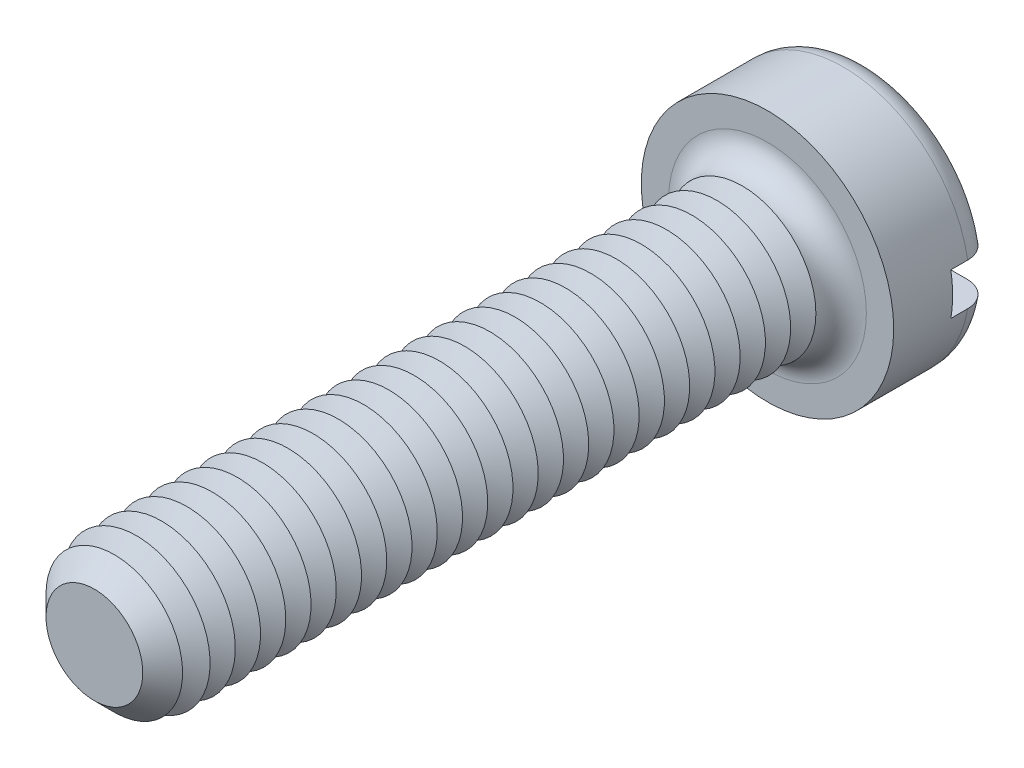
ISO-10303-21;
HEADER;
FILE_DESCRIPTION(('STEP AP214'),'2;1');
FILE_NAME('part.step','',(''),(''),'','','');
FILE_SCHEMA(('AUTOMOTIVE_DESIGN { 1 0 10303 214 1 1 1 1 }'));
ENDSEC;
DATA;
#1=APPLICATION_CONTEXT('core data for automotive mechanical design processes');
#2=APPLICATION_PROTOCOL_DEFINITION('international standard','automotive_design',2000,#1);
#3=PRODUCT_CONTEXT('',#1,'mechanical');
#4=PRODUCT('Part','Part','',(#3));
#5=PRODUCT_RELATED_PRODUCT_CATEGORY('part','',(#4));
#6=PRODUCT_DEFINITION_FORMATION('','',#4);
#7=PRODUCT_DEFINITION_CONTEXT('part definition',#1,'design');
#8=PRODUCT_DEFINITION('design','',#6,#7);
#9=PRODUCT_DEFINITION_SHAPE('','',#8);
#10=(LENGTH_UNIT() NAMED_UNIT(*) SI_UNIT(.MILLI.,.METRE.));
#11=(NAMED_UNIT(*) PLANE_ANGLE_UNIT() SI_UNIT($,.RADIAN.));
#12=(NAMED_UNIT(*) SI_UNIT($,.STERADIAN.) SOLID_ANGLE_UNIT());
#13=UNCERTAINTY_MEASURE_WITH_UNIT(LENGTH_MEASURE(1.E-05),#10,'distance_accuracy_value','');
#14=(GEOMETRIC_REPRESENTATION_CONTEXT(3) GLOBAL_UNCERTAINTY_ASSIGNED_CONTEXT((#13)) GLOBAL_UNIT_ASSIGNED_CONTEXT((#10,
#11,#12)) REPRESENTATION_CONTEXT('',''));
#15=CARTESIAN_POINT('',(0.,0.,0.));
#16=DIRECTION('',(0.,0.,1.));
#17=DIRECTION('',(1.,0.,0.));
#18=AXIS2_PLACEMENT_3D('',#15,#16,#17);
#19=CARTESIAN_POINT('',(0.,0.,-2.4));
#20=DIRECTION('',(0.,0.,1.));
#21=DIRECTION('',(1.,0.,0.));
#22=AXIS2_PLACEMENT_3D('',#19,#20,#21);
#23=PLANE('',#22);
#24=CARTESIAN_POINT('',(0.,0.,-2.4));
#25=DIRECTION('',(0.,0.,1.));
#26=DIRECTION('',(1.,0.,0.));
#27=AXIS2_PLACEMENT_3D('',#24,#25,#26);
#28=CIRCLE('',#27,2.4);
#29=CARTESIAN_POINT('',(-2.3473389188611,0.5,-2.4));
#30=VERTEX_POINT('',#29);
#31=CARTESIAN_POINT('',(2.3473389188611,0.5,-2.4));
#32=VERTEX_POINT('',#31);
#33=EDGE_CURVE('E116',#30,#32,#28,.F.);
#34=ORIENTED_EDGE('',*,*,#33,.T.);
#35=DIRECTION('',(1.,0.,0.));
#36=VECTOR('',#35,1.);
#37=CARTESIAN_POINT('',(-3.,0.5,-2.4));
#38=LINE('',#37,#36);
#39=EDGE_CURVE('E111',#30,#32,#38,.T.);
#40=ORIENTED_EDGE('',*,*,#39,.F.);
#41=EDGE_LOOP('',(#34,#40));
#42=FACE_BOUND('',#41,.T.);
#43=ADVANCED_FACE('F39',(#42),#23,.F.);
#44=CARTESIAN_POINT('',(0.,0.,-1.8));
#45=DIRECTION('',(0.,0.,1.));
#46=DIRECTION('',(1.,0.,0.));
#47=AXIS2_PLACEMENT_3D('',#44,#45,#46);
#48=TOROIDAL_SURFACE('',#47,2.4,0.6);
#49=CARTESIAN_POINT('',(-2.85761641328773,0.5,-2.13010535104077));
#50=CARTESIAN_POINT('',(-2.83871556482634,0.5,-2.1583605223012));
#51=CARTESIAN_POINT('',(-2.81738546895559,0.5,-2.18502342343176));
#52=CARTESIAN_POINT('',(-2.7705148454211,0.5,-2.23439244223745));
#53=CARTESIAN_POINT('',(-2.74496859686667,0.5,-2.25709309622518));
#54=CARTESIAN_POINT('',(-2.6904684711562,0.5,-2.29787524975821));
#55=CARTESIAN_POINT('',(-2.66151863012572,0.5,-2.3159621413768));
#56=CARTESIAN_POINT('',(-2.60103287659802,0.5,-2.34708203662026));
#57=CARTESIAN_POINT('',(-2.56949759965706,0.5,-2.36011627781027));
#58=CARTESIAN_POINT('',(-2.50430694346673,0.5,-2.38095952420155));
#59=CARTESIAN_POINT('',(-2.47062984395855,0.5,-2.38870056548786));
#60=CARTESIAN_POINT('',(-2.40245905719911,0.5,-2.39852415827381));
#61=CARTESIAN_POINT('',(-2.36796525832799,0.5,-2.40060593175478));
#62=CARTESIAN_POINT('',(-2.29850850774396,0.5,-2.39907718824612));
#63=CARTESIAN_POINT('',(-2.2635477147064,0.5,-2.3953679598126));
#64=CARTESIAN_POINT('',(-2.19472542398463,0.5,-2.38219781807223));
#65=CARTESIAN_POINT('',(-2.16086402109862,0.5,-2.37273641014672));
#66=CARTESIAN_POINT('',(-2.09483473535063,0.5,-2.3481926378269));
#67=CARTESIAN_POINT('',(-2.06268841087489,0.5,-2.3330521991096));
#68=CARTESIAN_POINT('',(-2.00140871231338,0.5,-2.29756210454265));
#69=CARTESIAN_POINT('',(-1.97227539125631,0.5,-2.27721235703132));
#70=CARTESIAN_POINT('',(-1.91805676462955,0.5,-2.23196210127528));
#71=CARTESIAN_POINT('',(-1.89294995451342,0.5,-2.20708739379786));
#72=CARTESIAN_POINT('',(-1.84740424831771,0.5,-2.1533758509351));
#73=CARTESIAN_POINT('',(-1.82696468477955,0.5,-2.12453958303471));
#74=CARTESIAN_POINT('',(-1.7919439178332,0.5,-2.06452274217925));
#75=CARTESIAN_POINT('',(-1.7772221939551,0.5,-2.03342424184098));
#76=CARTESIAN_POINT('',(-1.75343025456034,0.5,-1.96913621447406));
#77=CARTESIAN_POINT('',(-1.74435859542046,0.5,-1.93594722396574));
#78=CARTESIAN_POINT('',(-1.73243855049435,0.5,-1.86969199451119));
#79=CARTESIAN_POINT('',(-1.72938008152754,0.5,-1.83666346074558));
#80=CARTESIAN_POINT('',(-1.72896592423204,0.5,-1.77057287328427));
#81=CARTESIAN_POINT('',(-1.73160950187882,0.5,-1.73751082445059));
#82=CARTESIAN_POINT('',(-1.7423966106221,0.5,-1.67291835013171));
#83=CARTESIAN_POINT('',(-1.75043952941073,0.5,-1.64137102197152));
#84=CARTESIAN_POINT('',(-1.77163396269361,0.5,-1.58004446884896));
#85=CARTESIAN_POINT('',(-1.78478577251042,0.5,-1.55026534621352));
#86=CARTESIAN_POINT('',(-1.81598186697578,0.5,-1.49283859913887));
#87=CARTESIAN_POINT('',(-1.83409369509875,0.5,-1.46522772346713));
#88=CARTESIAN_POINT('',(-1.87455179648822,0.5,-1.41330756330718));
#89=CARTESIAN_POINT('',(-1.89689874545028,0.5,-1.38899880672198));
#90=CARTESIAN_POINT('',(-1.94600584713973,0.5,-1.34349499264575));
#91=CARTESIAN_POINT('',(-1.97289034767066,0.5,-1.32243411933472));
#92=CARTESIAN_POINT('',(-2.02972905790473,0.5,-1.28496935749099));
#93=CARTESIAN_POINT('',(-2.05968375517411,0.5,-1.26856621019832));
#94=CARTESIAN_POINT('',(-2.12276894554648,0.5,-1.24040709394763));
#95=CARTESIAN_POINT('',(-2.15596700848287,0.5,-1.22880230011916));
#96=CARTESIAN_POINT('',(-2.22383000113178,0.5,-1.21126311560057));
#97=CARTESIAN_POINT('',(-2.25849504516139,0.5,-1.20532916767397));
#98=CARTESIAN_POINT('',(-2.32870403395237,0.5,-1.1992792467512));
#99=CARTESIAN_POINT('',(-2.36425340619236,0.5,-1.19922586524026));
#100=CARTESIAN_POINT('',(-2.4348506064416,0.5,-1.2051326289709));
#101=CARTESIAN_POINT('',(-2.4698984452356,0.5,-1.21109264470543));
#102=CARTESIAN_POINT('',(-2.53821803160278,0.5,-1.22883658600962));
#103=CARTESIAN_POINT('',(-2.57150081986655,0.5,-1.24057794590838));
#104=CARTESIAN_POINT('',(-2.63557260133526,0.5,-1.2695744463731));
#105=CARTESIAN_POINT('',(-2.66636179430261,0.5,-1.28682914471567));
#106=CARTESIAN_POINT('',(-2.72402406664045,0.5,-1.32606063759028));
#107=CARTESIAN_POINT('',(-2.75095352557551,0.5,-1.34795455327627));
#108=CARTESIAN_POINT('',(-2.80067182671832,0.5,-1.39602603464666));
#109=CARTESIAN_POINT('',(-2.82346106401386,0.5,-1.42220319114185));
#110=CARTESIAN_POINT('',(-2.86383281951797,0.5,-1.47760238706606));
#111=CARTESIAN_POINT('',(-2.88149947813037,0.5,-1.50676312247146));
#112=CARTESIAN_POINT('',(-2.91160874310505,0.5,-1.56766595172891));
#113=CARTESIAN_POINT('',(-2.92405198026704,0.5,-1.59940773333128));
#114=CARTESIAN_POINT('',(-2.94319943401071,0.5,-1.66411282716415));
#115=CARTESIAN_POINT('',(-2.94997843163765,0.5,-1.69705402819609));
#116=CARTESIAN_POINT('',(-2.95787009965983,0.5,-1.7636173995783));
#117=CARTESIAN_POINT('',(-2.95898157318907,0.5,-1.79723971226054));
#118=CARTESIAN_POINT('',(-2.95551354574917,0.5,-1.86397776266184));
#119=CARTESIAN_POINT('',(-2.95096897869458,0.5,-1.89709534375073));
#120=CARTESIAN_POINT('',(-2.93638731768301,0.5,-1.96206785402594));
#121=CARTESIAN_POINT('',(-2.92635713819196,0.5,-1.99392431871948));
#122=CARTESIAN_POINT('',(-2.90618743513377,0.5,-2.04315073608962));
#123=CARTESIAN_POINT('',(-2.89769874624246,0.5,-2.06121519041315));
#124=CARTESIAN_POINT('',(-2.87895753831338,0.5,-2.096404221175));
#125=CARTESIAN_POINT('',(-2.86870503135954,0.5,-2.11352880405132));
#126=CARTESIAN_POINT('',(-2.85761641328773,0.5,-2.13010535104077));
#127=B_SPLINE_CURVE_WITH_KNOTS('',3,(#49,#50,#51,#52,#53,#54,#55,#56,#57,#58,#59,#60,#61,#62,
#63,#64,#65,#66,#67,#68,#69,#70,#71,#72,#73,#74,#75,#76,#77,#78,#79,#80,#81,#82,#83,#84,#85,#86,
#87,#88,#89,#90,#91,#92,#93,#94,#95,#96,#97,#98,#99,#100,#101,#102,#103,#104,#105,#106,#107,
#108,#109,#110,#111,#112,#113,#114,#115,#116,#117,#118,#119,#120,#121,#122,#123,#124,#125,#126),
.UNSPECIFIED.,.T.,.F.,(4,2,2,2,2,2,2,2,2,2,2,2,2,2,2,2,2,2,2,2,2,2,2,2,2,2,2,2,2,2,2,2,2,2,2,2,
2,2,4),(0.,0.101907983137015,0.203955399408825,0.305883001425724,0.407785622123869,
0.510973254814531,0.614175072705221,0.719155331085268,0.824144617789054,0.930238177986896,
1.03633360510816,1.14184204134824,1.24733537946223,1.35004136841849,1.45272110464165,
1.5517448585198,1.65075586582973,1.74797128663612,1.84519232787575,1.9438094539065,
2.0424423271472,2.14443321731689,2.24644032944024,2.35145317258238,2.45647421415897,
2.56261297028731,2.66874944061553,2.77411589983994,2.87947390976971,2.98308820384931,
3.08669260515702,3.18848388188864,3.29026286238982,3.39067588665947,3.49111011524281,
3.59092708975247,3.69061853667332,3.75040561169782,3.81019227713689),.UNSPECIFIED.);
#128=CARTESIAN_POINT('',(-2.95803989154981,0.5,-1.8));
#129=VERTEX_POINT('',#128);
#130=EDGE_CURVE('E385',#129,#30,#127,.T.);
#131=ORIENTED_EDGE('',*,*,#130,.F.);
#132=CARTESIAN_POINT('',(0.,0.,-1.8));
#133=DIRECTION('',(0.,0.,1.));
#134=DIRECTION('',(1.,0.,0.));
#135=AXIS2_PLACEMENT_3D('',#132,#133,#134);
#136=CIRCLE('',#135,3.);
#137=CARTESIAN_POINT('',(2.95803989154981,0.5,-1.8));
#138=VERTEX_POINT('',#137);
#139=EDGE_CURVE('E125',#138,#129,#136,.T.);
#140=ORIENTED_EDGE('',*,*,#139,.F.);
#141=CARTESIAN_POINT('',(1.78664846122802,0.5,-2.05158390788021));
#142=CARTESIAN_POINT('',(1.80142751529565,0.5,-2.08239430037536));
#143=CARTESIAN_POINT('',(1.81889355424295,0.5,-2.111949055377));
#144=CARTESIAN_POINT('',(1.8585933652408,0.5,-2.16770384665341));
#145=CARTESIAN_POINT('',(1.88083491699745,0.5,-2.19389829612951));
#146=CARTESIAN_POINT('',(1.92931942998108,0.5,-2.24217519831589));
#147=CARTESIAN_POINT('',(1.95555471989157,0.5,-2.26426535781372));
#148=CARTESIAN_POINT('',(2.01127789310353,0.5,-2.30384045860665));
#149=CARTESIAN_POINT('',(2.04076488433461,0.5,-2.32132665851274));
#150=CARTESIAN_POINT('',(2.10290022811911,0.5,-2.3516259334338));
#151=CARTESIAN_POINT('',(2.13560600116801,0.5,-2.3643213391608));
#152=CARTESIAN_POINT('',(2.20267136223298,0.5,-2.38412242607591));
#153=CARTESIAN_POINT('',(2.23703118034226,0.5,-2.3912273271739));
#154=CARTESIAN_POINT('',(2.30690186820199,0.5,-2.39969404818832));
#155=CARTESIAN_POINT('',(2.34242185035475,0.5,-2.40098100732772));
#156=CARTESIAN_POINT('',(2.41317063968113,0.5,-2.39753827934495));
#157=CARTESIAN_POINT('',(2.44839945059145,0.5,-2.39280866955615));
#158=CARTESIAN_POINT('',(2.51734146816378,0.5,-2.37746773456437));
#159=CARTESIAN_POINT('',(2.55106223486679,0.5,-2.3668904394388));
#160=CARTESIAN_POINT('',(2.61620389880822,0.5,-2.34013333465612));
#161=CARTESIAN_POINT('',(2.64762498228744,0.5,-2.32395397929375));
#162=CARTESIAN_POINT('',(2.70673284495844,0.5,-2.28672393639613));
#163=CARTESIAN_POINT('',(2.73447138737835,0.5,-2.26575544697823));
#164=CARTESIAN_POINT('',(2.78595339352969,0.5,-2.21938197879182));
#165=CARTESIAN_POINT('',(2.80969724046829,0.5,-2.19397742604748));
#166=CARTESIAN_POINT('',(2.85207235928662,0.5,-2.13993965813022));
#167=CARTESIAN_POINT('',(2.87078674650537,0.5,-2.11137160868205));
#168=CARTESIAN_POINT('',(2.90307455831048,0.5,-2.05146448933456));
#169=CARTESIAN_POINT('',(2.91664841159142,0.5,-2.02012565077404));
#170=CARTESIAN_POINT('',(2.93808283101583,0.5,-1.95603682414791));
#171=CARTESIAN_POINT('',(2.94602016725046,0.5,-1.92331249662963));
#172=CARTESIAN_POINT('',(2.95624273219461,0.5,-1.85699296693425));
#173=CARTESIAN_POINT('',(2.95852824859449,0.5,-1.82339780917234));
#174=CARTESIAN_POINT('',(2.95738171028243,0.5,-1.75655451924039));
#175=CARTESIAN_POINT('',(2.95399174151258,0.5,-1.72330565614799));
#176=CARTESIAN_POINT('',(2.94167749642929,0.5,-1.65784996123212));
#177=CARTESIAN_POINT('',(2.93275329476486,0.5,-1.62564311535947));
#178=CARTESIAN_POINT('',(2.90963870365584,0.5,-1.56317641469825));
#179=CARTESIAN_POINT('',(2.89544787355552,0.5,-1.53291672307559));
#180=CARTESIAN_POINT('',(2.86222325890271,0.5,-1.47518589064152));
#181=CARTESIAN_POINT('',(2.84318935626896,0.5,-1.44771481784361));
#182=CARTESIAN_POINT('',(2.80067851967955,0.5,-1.39611362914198));
#183=CARTESIAN_POINT('',(2.77716960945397,0.5,-1.37200986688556));
#184=CARTESIAN_POINT('',(2.72648704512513,0.5,-1.3280274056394));
#185=CARTESIAN_POINT('',(2.69931317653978,0.5,-1.3081489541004));
#186=CARTESIAN_POINT('',(2.64167967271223,0.5,-1.27288334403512));
#187=CARTESIAN_POINT('',(2.61118015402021,0.5,-1.25756138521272));
#188=CARTESIAN_POINT('',(2.54807315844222,0.5,-1.2321564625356));
#189=CARTESIAN_POINT('',(2.51546550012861,0.5,-1.22207395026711));
#190=CARTESIAN_POINT('',(2.44846246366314,0.5,-1.20724783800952));
#191=CARTESIAN_POINT('',(2.41404584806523,0.5,-1.2026002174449));
#192=CARTESIAN_POINT('',(2.34491756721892,0.5,-1.19904907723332));
#193=CARTESIAN_POINT('',(2.3102058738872,0.5,-1.20014611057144));
#194=CARTESIAN_POINT('',(2.24087507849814,0.5,-1.20808958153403));
#195=CARTESIAN_POINT('',(2.20626660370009,0.5,-1.21502895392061));
#196=CARTESIAN_POINT('',(2.13868705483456,0.5,-1.23457616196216));
#197=CARTESIAN_POINT('',(2.10571611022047,0.5,-1.24718444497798));
#198=CARTESIAN_POINT('',(2.04212010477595,0.5,-1.2778419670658));
#199=CARTESIAN_POINT('',(2.0115131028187,0.5,-1.29592871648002));
#200=CARTESIAN_POINT('',(1.95381117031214,0.5,-1.33703838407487));
#201=CARTESIAN_POINT('',(1.92671618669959,0.5,-1.36006122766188));
#202=CARTESIAN_POINT('',(1.8771749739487,0.5,-1.41014760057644));
#203=CARTESIAN_POINT('',(1.85467966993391,0.5,-1.43716252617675));
#204=CARTESIAN_POINT('',(1.8147167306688,0.5,-1.49468601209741));
#205=CARTESIAN_POINT('',(1.79724791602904,0.5,-1.52519375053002));
#206=CARTESIAN_POINT('',(1.76843420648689,0.5,-1.58782676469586));
#207=CARTESIAN_POINT('',(1.75691546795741,0.5,-1.61987202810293));
#208=CARTESIAN_POINT('',(1.73963101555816,0.5,-1.68548715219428));
#209=CARTESIAN_POINT('',(1.73386545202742,0.5,-1.71905705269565));
#210=CARTESIAN_POINT('',(1.72840927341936,0.5,-1.78556262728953));
#211=CARTESIAN_POINT('',(1.72852416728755,0.5,-1.8184825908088));
#212=CARTESIAN_POINT('',(1.73434422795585,0.5,-1.88379362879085));
#213=CARTESIAN_POINT('',(1.74004181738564,0.5,-1.91618535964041));
#214=CARTESIAN_POINT('',(1.75312909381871,0.5,-1.96568884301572));
#215=CARTESIAN_POINT('',(1.75869685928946,0.5,-1.98330302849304));
#216=CARTESIAN_POINT('',(1.77146455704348,0.5,-2.01792824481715));
#217=CARTESIAN_POINT('',(1.7786644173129,0.5,-2.03493930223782));
#218=CARTESIAN_POINT('',(1.78664846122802,0.5,-2.05158390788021));
#219=B_SPLINE_CURVE_WITH_KNOTS('',3,(#141,#142,#143,#144,#145,#146,#147,#148,#149,#150,#151,
#152,#153,#154,#155,#156,#157,#158,#159,#160,#161,#162,#163,#164,#165,#166,#167,#168,#169,#170,
#171,#172,#173,#174,#175,#176,#177,#178,#179,#180,#181,#182,#183,#184,#185,#186,#187,#188,#189,
#190,#191,#192,#193,#194,#195,#196,#197,#198,#199,#200,#201,#202,#203,#204,#205,#206,#207,#208,
#209,#210,#211,#212,#213,#214,#215,#216,#217,#218),.UNSPECIFIED.,.T.,.F.,(4,2,2,2,2,2,2,2,2,2,2,
2,2,2,2,2,2,2,2,2,2,2,2,2,2,2,2,2,2,2,2,2,2,2,2,2,2,2,4),(0.,0.10244464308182,0.205057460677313,
0.307475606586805,0.409865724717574,0.514628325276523,0.619405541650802,0.72552718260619,
0.831647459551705,0.937156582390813,1.04265715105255,1.1464674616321,1.25026780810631,
1.3522293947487,1.45418247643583,1.55471883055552,1.6552500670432,1.75503912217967,
1.8548268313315,1.95462289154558,2.05442138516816,2.15496174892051,2.25550799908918,
2.35743049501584,2.45936177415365,2.56306719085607,2.66678259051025,2.77217967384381,
2.87758507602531,2.98372914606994,3.08987161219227,3.19481457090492,3.29973288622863,
3.40138228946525,3.50303434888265,3.60132659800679,3.69948562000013,3.75483142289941,
3.8101747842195),.UNSPECIFIED.);
#220=EDGE_CURVE('E387',#32,#138,#219,.T.);
#221=ORIENTED_EDGE('',*,*,#220,.F.);
#222=ORIENTED_EDGE('',*,*,#33,.F.);
#223=EDGE_LOOP('',(#131,#140,#221,#222));
#224=FACE_BOUND('',#223,.T.);
#225=ADVANCED_FACE('F369',(#224),#48,.T.);
#226=CARTESIAN_POINT('',(0.,0.,-2.4));
#227=DIRECTION('',(0.,0.,1.));
#228=DIRECTION('',(1.,0.,0.));
#229=AXIS2_PLACEMENT_3D('',#226,#227,#228);
#230=CYLINDRICAL_SURFACE('',#229,3.);
#231=DIRECTION('',(0.,0.,1.));
#232=VECTOR('',#231,1.);
#233=CARTESIAN_POINT('',(2.95803989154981,0.5,-2.4));
#234=LINE('',#233,#232);
#235=CARTESIAN_POINT('',(2.95803989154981,0.5,-1.4));
#236=VERTEX_POINT('',#235);
#237=EDGE_CURVE('E402',#138,#236,#234,.T.);
#238=ORIENTED_EDGE('',*,*,#237,.F.);
#239=ORIENTED_EDGE('',*,*,#139,.T.);
#240=DIRECTION('',(0.,0.,1.));
#241=VECTOR('',#240,1.);
#242=CARTESIAN_POINT('',(-2.95803989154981,0.5,-2.4));
#243=LINE('',#242,#241);
#244=CARTESIAN_POINT('',(-2.95803989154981,0.5,-1.4));
#245=VERTEX_POINT('',#244);
#246=EDGE_CURVE('E63',#245,#129,#243,.F.);
#247=ORIENTED_EDGE('',*,*,#246,.F.);
#248=CARTESIAN_POINT('',(0.,0.,-1.4));
#249=DIRECTION('',(0.,0.,-1.));
#250=DIRECTION('',(-1.,0.,0.));
#251=AXIS2_PLACEMENT_3D('',#248,#249,#250);
#252=CIRCLE('',#251,3.);
#253=CARTESIAN_POINT('',(-2.95803989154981,-0.5,-1.4));
#254=VERTEX_POINT('',#253);
#255=EDGE_CURVE('E43',#245,#254,#252,.F.);
#256=ORIENTED_EDGE('',*,*,#255,.T.);
#257=DIRECTION('',(0.,0.,1.));
#258=VECTOR('',#257,1.);
#259=CARTESIAN_POINT('',(-2.95803989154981,-0.5,-2.4));
#260=LINE('',#259,#258);
#261=CARTESIAN_POINT('',(-2.9580398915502,-0.5,-1.79999999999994));
#262=VERTEX_POINT('',#261);
#263=EDGE_CURVE('E399',#262,#254,#260,.T.);
#264=ORIENTED_EDGE('',*,*,#263,.F.);
#265=CARTESIAN_POINT('',(2.95803989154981,-0.5,-1.8));
#266=VERTEX_POINT('',#265);
#267=EDGE_CURVE('E127',#262,#266,#136,.T.);
#268=ORIENTED_EDGE('',*,*,#267,.T.);
#269=DIRECTION('',(0.,0.,1.));
#270=VECTOR('',#269,1.);
#271=CARTESIAN_POINT('',(2.95803989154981,-0.5,-2.4));
#272=LINE('',#271,#270);
#273=CARTESIAN_POINT('',(2.95803989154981,-0.5,-1.4));
#274=VERTEX_POINT('',#273);
#275=EDGE_CURVE('E55',#274,#266,#272,.F.);
#276=ORIENTED_EDGE('',*,*,#275,.F.);
#277=EDGE_CURVE('E11',#274,#236,#252,.F.);
#278=ORIENTED_EDGE('',*,*,#277,.T.);
#279=EDGE_LOOP('',(#238,#239,#247,#256,#264,#268,#276,#278));
#280=FACE_BOUND('',#279,.T.);
#281=CARTESIAN_POINT('',(0.,0.,0.));
#282=DIRECTION('',(0.,0.,1.));
#283=DIRECTION('',(1.,0.,0.));
#284=AXIS2_PLACEMENT_3D('',#281,#282,#283);
#285=CIRCLE('',#284,3.);
#286=CARTESIAN_POINT('',(3.,0.,0.));
#287=VERTEX_POINT('',#286);
#288=EDGE_CURVE('E404',#287,#287,#285,.T.);
#289=ORIENTED_EDGE('',*,*,#288,.F.);
#290=EDGE_LOOP('',(#289));
#291=FACE_BOUND('',#290,.T.);
#292=ADVANCED_FACE('F365',(#280,#291),#230,.T.);
#293=CARTESIAN_POINT('',(2.3473389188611,-0.5,-2.4));
#294=VERTEX_POINT('',#293);
#295=CARTESIAN_POINT('',(-2.3473389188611,-0.5,-2.4));
#296=VERTEX_POINT('',#295);
#297=EDGE_CURVE('E109',#294,#296,#28,.F.);
#298=ORIENTED_EDGE('',*,*,#297,.T.);
#299=DIRECTION('',(-1.,0.,0.));
#300=VECTOR('',#299,1.);
#301=CARTESIAN_POINT('',(-3.,-0.5,-2.4));
#302=LINE('',#301,#300);
#303=EDGE_CURVE('E96',#294,#296,#302,.T.);
#304=ORIENTED_EDGE('',*,*,#303,.F.);
#305=EDGE_LOOP('',(#298,#304));
#306=FACE_BOUND('',#305,.T.);
#307=ADVANCED_FACE('F108',(#306),#23,.F.);
#308=CARTESIAN_POINT('',(0.,0.,0.));
#309=DIRECTION('',(0.,0.,1.));
#310=DIRECTION('',(1.,0.,0.));
#311=AXIS2_PLACEMENT_3D('',#308,#309,#310);
#312=PLANE('',#311);
#313=CARTESIAN_POINT('',(0.,0.,0.));
#314=DIRECTION('',(0.,0.,1.));
#315=DIRECTION('',(1.,0.,0.));
#316=AXIS2_PLACEMENT_3D('',#313,#314,#315);
#317=CIRCLE('',#316,2.35);
#318=CARTESIAN_POINT('',(2.35,0.,0.));
#319=VERTEX_POINT('',#318);
#320=EDGE_CURVE('E115',#319,#319,#317,.F.);
#321=ORIENTED_EDGE('',*,*,#320,.T.);
#322=EDGE_LOOP('',(#321));
#323=FACE_BOUND('',#322,.T.);
#324=ORIENTED_EDGE('',*,*,#288,.T.);
#325=EDGE_LOOP('',(#324));
#326=FACE_BOUND('',#325,.T.);
#327=ADVANCED_FACE('F364',(#323,#326),#312,.T.);
#328=CARTESIAN_POINT('',(-2.85761641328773,-0.5,-2.13010535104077));
#329=CARTESIAN_POINT('',(-2.87617085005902,-0.5,-2.10236255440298));
#330=CARTESIAN_POINT('',(-2.89241094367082,-0.5,-2.07304478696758));
#331=CARTESIAN_POINT('',(-2.91975805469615,-0.5,-2.01207835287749));
#332=CARTESIAN_POINT('',(-2.93085958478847,-0.5,-1.98042723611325));
#333=CARTESIAN_POINT('',(-2.94757590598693,-0.5,-1.91570997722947));
#334=CARTESIAN_POINT('',(-2.95319165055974,-0.5,-1.88264408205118));
#335=CARTESIAN_POINT('',(-2.95876526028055,-0.5,-1.81604673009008));
#336=CARTESIAN_POINT('',(-2.95872441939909,-0.5,-1.78251538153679));
#337=CARTESIAN_POINT('',(-2.95300126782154,-0.5,-1.71606888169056));
#338=CARTESIAN_POINT('',(-2.94734076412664,-0.5,-1.68315184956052));
#339=CARTESIAN_POINT('',(-2.93058183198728,-0.5,-1.61873244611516));
#340=CARTESIAN_POINT('',(-2.91948325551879,-0.5,-1.58723011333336));
#341=CARTESIAN_POINT('',(-2.89215903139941,-0.5,-1.52647404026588));
#342=CARTESIAN_POINT('',(-2.87592518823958,-0.5,-1.49722398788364));
#343=CARTESIAN_POINT('',(-2.83881787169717,-0.5,-1.44183365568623));
#344=CARTESIAN_POINT('',(-2.81794425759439,-0.5,-1.41569347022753));
#345=CARTESIAN_POINT('',(-2.77196258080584,-0.5,-1.36700890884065));
#346=CARTESIAN_POINT('',(-2.74681874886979,-0.5,-1.34449832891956));
#347=CARTESIAN_POINT('',(-2.69315595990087,-0.5,-1.30394571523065));
#348=CARTESIAN_POINT('',(-2.66463678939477,-0.5,-1.28590396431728));
#349=CARTESIAN_POINT('',(-2.6045885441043,-0.5,-1.25451133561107));
#350=CARTESIAN_POINT('',(-2.573021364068,-0.5,-1.24123336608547));
#351=CARTESIAN_POINT('',(-2.50813094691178,-0.5,-1.22006271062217));
#352=CARTESIAN_POINT('',(-2.47480755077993,-0.5,-1.21217051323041));
#353=CARTESIAN_POINT('',(-2.40672281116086,-0.5,-1.20185046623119));
#354=CARTESIAN_POINT('',(-2.37194646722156,-0.5,-1.19952155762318));
#355=CARTESIAN_POINT('',(-2.30248663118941,-0.5,-1.20064178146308));
#356=CARTESIAN_POINT('',(-2.26780314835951,-0.5,-1.20409147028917));
#357=CARTESIAN_POINT('',(-2.19896003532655,-0.5,-1.21674803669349));
#358=CARTESIAN_POINT('',(-2.16481620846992,-0.5,-1.22604100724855));
#359=CARTESIAN_POINT('',(-2.09855902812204,-0.5,-1.25020237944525));
#360=CARTESIAN_POINT('',(-2.0664458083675,-0.5,-1.2650711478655));
#361=CARTESIAN_POINT('',(-2.00504979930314,-0.5,-1.3000633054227));
#362=CARTESIAN_POINT('',(-1.97577870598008,-0.5,-1.32020724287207));
#363=CARTESIAN_POINT('',(-1.92109882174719,-0.5,-1.36519538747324));
#364=CARTESIAN_POINT('',(-1.89568984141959,-0.5,-1.39003936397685));
#365=CARTESIAN_POINT('',(-1.84992350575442,-0.5,-1.44333696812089));
#366=CARTESIAN_POINT('',(-1.82949305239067,-0.5,-1.47172774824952));
#367=CARTESIAN_POINT('',(-1.79388305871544,-0.5,-1.53163225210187));
#368=CARTESIAN_POINT('',(-1.77870235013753,-0.5,-1.56314527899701));
#369=CARTESIAN_POINT('',(-1.7545759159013,-0.5,-1.62726698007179));
#370=CARTESIAN_POINT('',(-1.74543784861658,-0.5,-1.65980327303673));
#371=CARTESIAN_POINT('',(-1.73294830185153,-0.5,-1.72596654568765));
#372=CARTESIAN_POINT('',(-1.72959555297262,-0.5,-1.7595932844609));
#373=CARTESIAN_POINT('',(-1.72881879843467,-0.5,-1.82588200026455));
#374=CARTESIAN_POINT('',(-1.73121660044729,-0.5,-1.85854202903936));
#375=CARTESIAN_POINT('',(-1.74148022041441,-0.5,-1.9229888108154));
#376=CARTESIAN_POINT('',(-1.74934586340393,-0.5,-1.95477559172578));
#377=CARTESIAN_POINT('',(-1.77023164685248,-0.5,-2.01650910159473));
#378=CARTESIAN_POINT('',(-1.78323812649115,-0.5,-2.04646046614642));
#379=CARTESIAN_POINT('',(-1.81396733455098,-0.5,-2.10383471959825));
#380=CARTESIAN_POINT('',(-1.83169061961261,-0.5,-2.13125730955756));
#381=CARTESIAN_POINT('',(-1.87183626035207,-0.5,-2.18359240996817));
#382=CARTESIAN_POINT('',(-1.89437158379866,-0.5,-2.20841820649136));
#383=CARTESIAN_POINT('',(-1.9431646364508,-0.5,-2.25409214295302));
#384=CARTESIAN_POINT('',(-1.96942301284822,-0.5,-2.27493958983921));
#385=CARTESIAN_POINT('',(-2.025898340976,-0.5,-2.31281042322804));
#386=CARTESIAN_POINT('',(-2.05622082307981,-0.5,-2.32967654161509));
#387=CARTESIAN_POINT('',(-2.11922391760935,-0.5,-2.35820255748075));
#388=CARTESIAN_POINT('',(-2.15190483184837,-0.5,-2.3698617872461));
#389=CARTESIAN_POINT('',(-2.21944675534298,-0.5,-2.38785911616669));
#390=CARTESIAN_POINT('',(-2.25433929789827,-0.5,-2.39407914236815));
#391=CARTESIAN_POINT('',(-2.32467357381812,-0.5,-2.40058243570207));
#392=CARTESIAN_POINT('',(-2.36011530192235,-0.5,-2.40086575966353));
#393=CARTESIAN_POINT('',(-2.43058129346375,-0.5,-2.39545061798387));
#394=CARTESIAN_POINT('',(-2.46560504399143,-0.5,-2.38974544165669));
#395=CARTESIAN_POINT('',(-2.53418188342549,-0.5,-2.37245602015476));
#396=CARTESIAN_POINT('',(-2.56773468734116,-0.5,-2.36087064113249));
#397=CARTESIAN_POINT('',(-2.63195003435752,-0.5,-2.33229154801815));
#398=CARTESIAN_POINT('',(-2.66264330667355,-0.5,-2.31536681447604));
#399=CARTESIAN_POINT('',(-2.72065333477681,-0.5,-2.2765252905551));
#400=CARTESIAN_POINT('',(-2.7479744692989,-0.5,-2.25461508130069));
#401=CARTESIAN_POINT('',(-2.78903570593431,-0.5,-2.21539504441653));
#402=CARTESIAN_POINT('',(-2.80405150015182,-0.5,-2.19939833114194));
#403=CARTESIAN_POINT('',(-2.83224965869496,-0.5,-2.16586257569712));
#404=CARTESIAN_POINT('',(-2.84543204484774,-0.5,-2.14832355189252));
#405=CARTESIAN_POINT('',(-2.85761641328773,-0.5,-2.13010535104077));
#406=B_SPLINE_CURVE_WITH_KNOTS('',3,(#328,#329,#330,#331,#332,#333,#334,#335,#336,#337,#338,
#339,#340,#341,#342,#343,#344,#345,#346,#347,#348,#349,#350,#351,#352,#353,#354,#355,#356,#357,
#358,#359,#360,#361,#362,#363,#364,#365,#366,#367,#368,#369,#370,#371,#372,#373,#374,#375,#376,
#377,#378,#379,#380,#381,#382,#383,#384,#385,#386,#387,#388,#389,#390,#391,#392,#393,#394,#395,
#396,#397,#398,#399,#400,#401,#402,#403,#404,#405),.UNSPECIFIED.,.T.,.F.,(4,2,2,2,2,2,2,2,2,2,2,
2,2,2,2,2,2,2,2,2,2,2,2,2,2,2,2,2,2,2,2,2,2,2,2,2,2,2,4),(0.,0.100047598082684,
0.200201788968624,0.300338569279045,0.400452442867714,0.500179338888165,0.599908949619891,
0.699798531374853,0.799691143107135,0.900465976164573,1.00124718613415,1.10351091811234,
1.20578392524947,1.30986270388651,1.41395150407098,1.51961105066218,1.62527754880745,
1.73136193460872,1.83744111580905,1.94185359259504,2.04624281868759,2.1471248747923,
2.24798479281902,2.34575994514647,2.44353196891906,2.541045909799,2.63857136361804,
2.73870431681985,2.83885469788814,2.94247024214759,3.0460990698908,3.15192527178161,
3.25775046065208,3.36369436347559,3.46965870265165,3.57430655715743,3.67881706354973,
3.74451732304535,3.81021680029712),.UNSPECIFIED.);
#407=EDGE_CURVE('E103',#296,#262,#406,.T.);
#408=ORIENTED_EDGE('',*,*,#407,.F.);
#409=ORIENTED_EDGE('',*,*,#297,.F.);
#410=CARTESIAN_POINT('',(1.78664846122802,-0.5,-2.05158390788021));
#411=CARTESIAN_POINT('',(1.77253256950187,-0.5,-2.02214917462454));
#412=CARTESIAN_POINT('',(1.76084795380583,-0.5,-1.99152692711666));
#413=CARTESIAN_POINT('',(1.74276267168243,-0.5,-1.92873811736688));
#414=CARTESIAN_POINT('',(1.73636622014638,-0.5,-1.89657034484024));
#415=CARTESIAN_POINT('',(1.72910271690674,-0.5,-1.83160458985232));
#416=CARTESIAN_POINT('',(1.72823699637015,-0.5,-1.79880645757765));
#417=CARTESIAN_POINT('',(1.73207277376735,-0.5,-1.73354460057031));
#418=CARTESIAN_POINT('',(1.7367732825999,-0.5,-1.70108081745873));
#419=CARTESIAN_POINT('',(1.75151033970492,-0.5,-1.63763571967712));
#420=CARTESIAN_POINT('',(1.76150868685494,-0.5,-1.60664550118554));
#421=CARTESIAN_POINT('',(1.78646773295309,-0.5,-1.54673433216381));
#422=CARTESIAN_POINT('',(1.80142897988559,-0.5,-1.51781361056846));
#423=CARTESIAN_POINT('',(1.8361687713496,-0.5,-1.46223275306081));
#424=CARTESIAN_POINT('',(1.85603637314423,-0.5,-1.43562834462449));
#425=CARTESIAN_POINT('',(1.89981598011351,-0.5,-1.38598822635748));
#426=CARTESIAN_POINT('',(1.92372865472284,-0.5,-1.3629531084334));
#427=CARTESIAN_POINT('',(1.97581791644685,-0.5,-1.32025912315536));
#428=CARTESIAN_POINT('',(2.00411431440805,-0.5,-1.30074638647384));
#429=CARTESIAN_POINT('',(2.06351340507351,-0.5,-1.26660223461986));
#430=CARTESIAN_POINT('',(2.09461651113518,-0.5,-1.2519715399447));
#431=CARTESIAN_POINT('',(2.15964055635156,-0.5,-1.22763649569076));
#432=CARTESIAN_POINT('',(2.19361437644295,-0.5,-1.21807321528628));
#433=CARTESIAN_POINT('',(2.26268197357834,-0.5,-1.20474094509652));
#434=CARTESIAN_POINT('',(2.29777581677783,-0.5,-1.20097229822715));
#435=CARTESIAN_POINT('',(2.36834397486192,-0.5,-1.19935270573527));
#436=CARTESIAN_POINT('',(2.40381924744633,-0.5,-1.20154258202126));
#437=CARTESIAN_POINT('',(2.47388621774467,-0.5,-1.211906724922));
#438=CARTESIAN_POINT('',(2.50847794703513,-0.5,-1.22008077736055));
#439=CARTESIAN_POINT('',(2.57542869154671,-0.5,-1.24211740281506));
#440=CARTESIAN_POINT('',(2.60780612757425,-0.5,-1.25592395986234));
#441=CARTESIAN_POINT('',(2.66972487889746,-0.5,-1.28886991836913));
#442=CARTESIAN_POINT('',(2.69926644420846,-0.5,-1.3080088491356));
#443=CARTESIAN_POINT('',(2.75412764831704,-0.5,-1.35072337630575));
#444=CARTESIAN_POINT('',(2.77951140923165,-0.5,-1.37421661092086));
#445=CARTESIAN_POINT('',(2.82588981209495,-0.5,-1.42519687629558));
#446=CARTESIAN_POINT('',(2.84688487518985,-0.5,-1.4526835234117));
#447=CARTESIAN_POINT('',(2.88351678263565,-0.5,-1.51036368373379));
#448=CARTESIAN_POINT('',(2.89923879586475,-0.5,-1.54050312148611));
#449=CARTESIAN_POINT('',(2.92532780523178,-0.5,-1.60301687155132));
#450=CARTESIAN_POINT('',(2.93569520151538,-0.5,-1.63539101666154));
#451=CARTESIAN_POINT('',(2.95066155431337,-0.5,-1.70102985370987));
#452=CARTESIAN_POINT('',(2.95532930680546,-0.5,-1.73427887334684));
#453=CARTESIAN_POINT('',(2.9589838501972,-0.5,-1.80108716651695));
#454=CARTESIAN_POINT('',(2.95797087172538,-0.5,-1.83464642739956));
#455=CARTESIAN_POINT('',(2.9503157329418,-0.5,-1.90093629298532));
#456=CARTESIAN_POINT('',(2.9437032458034,-0.5,-1.93367033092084));
#457=CARTESIAN_POINT('',(2.92508830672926,-0.5,-1.99756717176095));
#458=CARTESIAN_POINT('',(2.91308586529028,-0.5,-2.02872997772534));
#459=CARTESIAN_POINT('',(2.88401713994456,-0.5,-2.08868263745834));
#460=CARTESIAN_POINT('',(2.86693946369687,-0.5,-2.11746696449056));
#461=CARTESIAN_POINT('',(2.82823635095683,-0.5,-2.17179415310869));
#462=CARTESIAN_POINT('',(2.80661076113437,-0.5,-2.19733690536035));
#463=CARTESIAN_POINT('',(2.75921750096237,-0.5,-2.24472182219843));
#464=CARTESIAN_POINT('',(2.73341278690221,-0.5,-2.26652692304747));
#465=CARTESIAN_POINT('',(2.67855512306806,-0.5,-2.30557116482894));
#466=CARTESIAN_POINT('',(2.64950194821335,-0.5,-2.32280998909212));
#467=CARTESIAN_POINT('',(2.58850670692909,-0.5,-2.35251615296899));
#468=CARTESIAN_POINT('',(2.55652763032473,-0.5,-2.36490748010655));
#469=CARTESIAN_POINT('',(2.4909651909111,-0.5,-2.38424946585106));
#470=CARTESIAN_POINT('',(2.45738167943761,-0.5,-2.39119961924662));
#471=CARTESIAN_POINT('',(2.38892891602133,-0.5,-2.39958830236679));
#472=CARTESIAN_POINT('',(2.35404742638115,-0.5,-2.40092701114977));
#473=CARTESIAN_POINT('',(2.28454389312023,-0.5,-2.39781917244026));
#474=CARTESIAN_POINT('',(2.24992186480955,-0.5,-2.39337228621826));
#475=CARTESIAN_POINT('',(2.18139250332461,-0.5,-2.37872879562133));
#476=CARTESIAN_POINT('',(2.14750264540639,-0.5,-2.36845030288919));
#477=CARTESIAN_POINT('',(2.08190943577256,-0.5,-2.34236291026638));
#478=CARTESIAN_POINT('',(2.05020675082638,-0.5,-2.32655233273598));
#479=CARTESIAN_POINT('',(1.98982495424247,-0.5,-2.28976285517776));
#480=CARTESIAN_POINT('',(1.96115527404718,-0.5,-2.26876847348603));
#481=CARTESIAN_POINT('',(1.90785147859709,-0.5,-2.22220002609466));
#482=CARTESIAN_POINT('',(1.88321231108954,-0.5,-2.19663177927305));
#483=CARTESIAN_POINT('',(1.84638483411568,-0.5,-2.15106161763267));
#484=CARTESIAN_POINT('',(1.8328227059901,-0.5,-2.13215328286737));
#485=CARTESIAN_POINT('',(1.80797918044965,-0.5,-2.09289185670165));
#486=CARTESIAN_POINT('',(1.79669771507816,-0.5,-2.07253880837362));
#487=CARTESIAN_POINT('',(1.78664846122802,-0.5,-2.05158390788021));
#488=B_SPLINE_CURVE_WITH_KNOTS('',3,(#410,#411,#412,#413,#414,#415,#416,#417,#418,#419,#420,
#421,#422,#423,#424,#425,#426,#427,#428,#429,#430,#431,#432,#433,#434,#435,#436,#437,#438,#439,
#440,#441,#442,#443,#444,#445,#446,#447,#448,#449,#450,#451,#452,#453,#454,#455,#456,#457,#458,
#459,#460,#461,#462,#463,#464,#465,#466,#467,#468,#469,#470,#471,#472,#473,#474,#475,#476,#477,
#478,#479,#480,#481,#482,#483,#484,#485,#486,#487),.UNSPECIFIED.,.T.,.F.,(4,2,2,2,2,2,2,2,2,2,2,
2,2,2,2,2,2,2,2,2,2,2,2,2,2,2,2,2,2,2,2,2,2,2,2,2,2,2,4),(0.,0.0978512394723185,0.19578039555,
0.293733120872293,0.391668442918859,0.488907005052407,0.58615630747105,0.685320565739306,
0.784501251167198,0.887148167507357,0.989810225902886,1.09519726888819,1.20059054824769,
1.30670769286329,1.41282103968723,1.51790384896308,1.62297738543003,1.72623563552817,
1.82948397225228,1.93097382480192,2.03245609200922,2.13270093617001,2.23294171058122,
2.33265458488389,2.43236726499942,2.53230548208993,2.63224706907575,2.73312861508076,
2.83401715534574,2.93642973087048,3.03885181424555,3.14308833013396,3.24733094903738,
3.35307493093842,3.45885100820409,3.56494689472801,3.67090875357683,3.74057217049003,
3.81023351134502),.UNSPECIFIED.);
#489=EDGE_CURVE('E92',#266,#294,#488,.T.);
#490=ORIENTED_EDGE('',*,*,#489,.F.);
#491=ORIENTED_EDGE('',*,*,#267,.F.);
#492=EDGE_LOOP('',(#408,#409,#490,#491));
#493=FACE_BOUND('',#492,.T.);
#494=ADVANCED_FACE('F113',(#493),#48,.T.);
#495=CARTESIAN_POINT('',(0.,0.,0.6));
#496=DIRECTION('',(0.,0.,1.));
#497=DIRECTION('',(1.,0.,0.));
#498=AXIS2_PLACEMENT_3D('',#495,#496,#497);
#499=TOROIDAL_SURFACE('',#498,2.35,0.6);
#500=ORIENTED_EDGE('',*,*,#320,.F.);
#501=EDGE_LOOP('',(#500));
#502=FACE_BOUND('',#501,.T.);
#503=CARTESIAN_POINT('',(0.,0.,0.6));
#504=DIRECTION('',(0.,0.,-1.));
#505=DIRECTION('',(-1.,0.,0.));
#506=AXIS2_PLACEMENT_3D('',#503,#504,#505);
#507=CIRCLE('',#506,1.75);
#508=CARTESIAN_POINT('',(-1.75,0.,0.6));
#509=VERTEX_POINT('',#508);
#510=EDGE_CURVE('E409',#509,#509,#507,.T.);
#511=ORIENTED_EDGE('',*,*,#510,.T.);
#512=EDGE_LOOP('',(#511));
#513=FACE_BOUND('',#512,.T.);
#514=ADVANCED_FACE('F357',(#502,#513),#499,.F.);
#515=CARTESIAN_POINT('',(0.,0.,0.9));
#516=DIRECTION('',(0.,0.,-1.));
#517=DIRECTION('',(-1.,0.,0.));
#518=AXIS2_PLACEMENT_3D('',#515,#516,#517);
#519=CONICAL_SURFACE('',#518,1.23038475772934,1.0471975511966);
#520=ORIENTED_EDGE('',*,*,#510,.F.);
#521=EDGE_LOOP('',(#520));
#522=FACE_BOUND('',#521,.T.);
#523=CARTESIAN_POINT('',(0.,0.,0.9));
#524=DIRECTION('',(0.,0.,-1.));
#525=DIRECTION('',(-1.,0.,0.));
#526=AXIS2_PLACEMENT_3D('',#523,#524,#525);
#527=CIRCLE('',#526,1.23038475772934);
#528=CARTESIAN_POINT('',(-1.23038475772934,0.,0.9));
#529=VERTEX_POINT('',#528);
#530=EDGE_CURVE('E415',#529,#529,#527,.T.);
#531=ORIENTED_EDGE('',*,*,#530,.T.);
#532=EDGE_LOOP('',(#531));
#533=FACE_BOUND('',#532,.T.);
#534=ADVANCED_FACE('F353',(#522,#533),#519,.T.);
#535=CARTESIAN_POINT('',(0.,0.,1.2));
#536=DIRECTION('',(0.,0.,1.));
#537=DIRECTION('',(1.,0.,0.));
#538=AXIS2_PLACEMENT_3D('',#535,#536,#537);
#539=CONICAL_SURFACE('',#538,1.75,1.0471975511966);
#540=ORIENTED_EDGE('',*,*,#530,.F.);
#541=EDGE_LOOP('',(#540));
#542=FACE_BOUND('',#541,.T.);
#543=CARTESIAN_POINT('',(0.,0.,1.2));
#544=DIRECTION('',(0.,0.,-1.));
#545=DIRECTION('',(-1.,0.,0.));
#546=AXIS2_PLACEMENT_3D('',#543,#544,#545);
#547=CIRCLE('',#546,1.75);
#548=CARTESIAN_POINT('',(-1.75,0.,1.2));
#549=VERTEX_POINT('',#548);
#550=EDGE_CURVE('E421',#549,#549,#547,.T.);
#551=ORIENTED_EDGE('',*,*,#550,.T.);
#552=EDGE_LOOP('',(#551));
#553=FACE_BOUND('',#552,.T.);
#554=ADVANCED_FACE('F349',(#542,#553),#539,.T.);
#555=CARTESIAN_POINT('',(0.,0.,1.5));
#556=DIRECTION('',(0.,0.,-1.));
#557=DIRECTION('',(-1.,0.,0.));
#558=AXIS2_PLACEMENT_3D('',#555,#556,#557);
#559=CONICAL_SURFACE('',#558,1.23038475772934,1.0471975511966);
#560=ORIENTED_EDGE('',*,*,#550,.F.);
#561=EDGE_LOOP('',(#560));
#562=FACE_BOUND('',#561,.T.);
#563=CARTESIAN_POINT('',(0.,0.,1.5));
#564=DIRECTION('',(0.,0.,-1.));
#565=DIRECTION('',(-1.,0.,0.));
#566=AXIS2_PLACEMENT_3D('',#563,#564,#565);
#567=CIRCLE('',#566,1.23038475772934);
#568=CARTESIAN_POINT('',(-1.23038475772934,0.,1.5));
#569=VERTEX_POINT('',#568);
#570=EDGE_CURVE('E425',#569,#569,#567,.T.);
#571=ORIENTED_EDGE('',*,*,#570,.T.);
#572=EDGE_LOOP('',(#571));
#573=FACE_BOUND('',#572,.T.);
#574=ADVANCED_FACE('F345',(#562,#573),#559,.T.);
#575=CARTESIAN_POINT('',(0.,0.,1.8));
#576=DIRECTION('',(0.,0.,1.));
#577=DIRECTION('',(1.,0.,0.));
#578=AXIS2_PLACEMENT_3D('',#575,#576,#577);
#579=CONICAL_SURFACE('',#578,1.75,1.0471975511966);
#580=ORIENTED_EDGE('',*,*,#570,.F.);
#581=EDGE_LOOP('',(#580));
#582=FACE_BOUND('',#581,.T.);
#583=CARTESIAN_POINT('',(0.,0.,1.8));
#584=DIRECTION('',(0.,0.,-1.));
#585=DIRECTION('',(-1.,0.,0.));
#586=AXIS2_PLACEMENT_3D('',#583,#584,#585);
#587=CIRCLE('',#586,1.75);
#588=CARTESIAN_POINT('',(-1.75,0.,1.8));
#589=VERTEX_POINT('',#588);
#590=EDGE_CURVE('E429',#589,#589,#587,.T.);
#591=ORIENTED_EDGE('',*,*,#590,.T.);
#592=EDGE_LOOP('',(#591));
#593=FACE_BOUND('',#592,.T.);
#594=ADVANCED_FACE('F341',(#582,#593),#579,.T.);
#595=CARTESIAN_POINT('',(0.,0.,2.1));
#596=DIRECTION('',(0.,0.,-1.));
#597=DIRECTION('',(-1.,0.,0.));
#598=AXIS2_PLACEMENT_3D('',#595,#596,#597);
#599=CONICAL_SURFACE('',#598,1.23038475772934,1.0471975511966);
#600=ORIENTED_EDGE('',*,*,#590,.F.);
#601=EDGE_LOOP('',(#600));
#602=FACE_BOUND('',#601,.T.);
#603=CARTESIAN_POINT('',(0.,0.,2.1));
#604=DIRECTION('',(0.,0.,-1.));
#605=DIRECTION('',(-1.,0.,0.));
#606=AXIS2_PLACEMENT_3D('',#603,#604,#605);
#607=CIRCLE('',#606,1.23038475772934);
#608=CARTESIAN_POINT('',(-1.23038475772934,0.,2.1));
#609=VERTEX_POINT('',#608);
#610=EDGE_CURVE('E433',#609,#609,#607,.T.);
#611=ORIENTED_EDGE('',*,*,#610,.T.);
#612=EDGE_LOOP('',(#611));
#613=FACE_BOUND('',#612,.T.);
#614=ADVANCED_FACE('F337',(#602,#613),#599,.T.);
#615=CARTESIAN_POINT('',(0.,0.,2.4));
#616=DIRECTION('',(0.,0.,1.));
#617=DIRECTION('',(1.,0.,0.));
#618=AXIS2_PLACEMENT_3D('',#615,#616,#617);
#619=CONICAL_SURFACE('',#618,1.75,1.0471975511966);
#620=ORIENTED_EDGE('',*,*,#610,.F.);
#621=EDGE_LOOP('',(#620));
#622=FACE_BOUND('',#621,.T.);
#623=CARTESIAN_POINT('',(0.,0.,2.4));
#624=DIRECTION('',(0.,0.,-1.));
#625=DIRECTION('',(-1.,0.,0.));
#626=AXIS2_PLACEMENT_3D('',#623,#624,#625);
#627=CIRCLE('',#626,1.75);
#628=CARTESIAN_POINT('',(-1.75,0.,2.4));
#629=VERTEX_POINT('',#628);
#630=EDGE_CURVE('E437',#629,#629,#627,.T.);
#631=ORIENTED_EDGE('',*,*,#630,.T.);
#632=EDGE_LOOP('',(#631));
#633=FACE_BOUND('',#632,.T.);
#634=ADVANCED_FACE('F333',(#622,#633),#619,.T.);
#635=CARTESIAN_POINT('',(0.,0.,2.7));
#636=DIRECTION('',(0.,0.,-1.));
#637=DIRECTION('',(-1.,0.,0.));
#638=AXIS2_PLACEMENT_3D('',#635,#636,#637);
#639=CONICAL_SURFACE('',#638,1.23038475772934,1.0471975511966);
#640=ORIENTED_EDGE('',*,*,#630,.F.);
#641=EDGE_LOOP('',(#640));
#642=FACE_BOUND('',#641,.T.);
#643=CARTESIAN_POINT('',(0.,0.,2.7));
#644=DIRECTION('',(0.,0.,-1.));
#645=DIRECTION('',(-1.,0.,0.));
#646=AXIS2_PLACEMENT_3D('',#643,#644,#645);
#647=CIRCLE('',#646,1.23038475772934);
#648=CARTESIAN_POINT('',(-1.23038475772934,0.,2.7));
#649=VERTEX_POINT('',#648);
#650=EDGE_CURVE('E441',#649,#649,#647,.T.);
#651=ORIENTED_EDGE('',*,*,#650,.T.);
#652=EDGE_LOOP('',(#651));
#653=FACE_BOUND('',#652,.T.);
#654=ADVANCED_FACE('F329',(#642,#653),#639,.T.);
#655=CARTESIAN_POINT('',(0.,0.,3.));
#656=DIRECTION('',(0.,0.,1.));
#657=DIRECTION('',(1.,0.,0.));
#658=AXIS2_PLACEMENT_3D('',#655,#656,#657);
#659=CONICAL_SURFACE('',#658,1.75,1.0471975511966);
#660=ORIENTED_EDGE('',*,*,#650,.F.);
#661=EDGE_LOOP('',(#660));
#662=FACE_BOUND('',#661,.T.);
#663=CARTESIAN_POINT('',(0.,0.,3.));
#664=DIRECTION('',(0.,0.,-1.));
#665=DIRECTION('',(-1.,0.,0.));
#666=AXIS2_PLACEMENT_3D('',#663,#664,#665);
#667=CIRCLE('',#666,1.75);
#668=CARTESIAN_POINT('',(-1.75,0.,3.));
#669=VERTEX_POINT('',#668);
#670=EDGE_CURVE('E445',#669,#669,#667,.T.);
#671=ORIENTED_EDGE('',*,*,#670,.T.);
#672=EDGE_LOOP('',(#671));
#673=FACE_BOUND('',#672,.T.);
#674=ADVANCED_FACE('F325',(#662,#673),#659,.T.);
#675=CARTESIAN_POINT('',(0.,0.,3.3));
#676=DIRECTION('',(0.,0.,-1.));
#677=DIRECTION('',(-1.,0.,0.));
#678=AXIS2_PLACEMENT_3D('',#675,#676,#677);
#679=CONICAL_SURFACE('',#678,1.23038475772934,1.0471975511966);
#680=ORIENTED_EDGE('',*,*,#670,.F.);
#681=EDGE_LOOP('',(#680));
#682=FACE_BOUND('',#681,.T.);
#683=CARTESIAN_POINT('',(0.,0.,3.3));
#684=DIRECTION('',(0.,0.,-1.));
#685=DIRECTION('',(-1.,0.,0.));
#686=AXIS2_PLACEMENT_3D('',#683,#684,#685);
#687=CIRCLE('',#686,1.23038475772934);
#688=CARTESIAN_POINT('',(-1.23038475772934,0.,3.3));
#689=VERTEX_POINT('',#688);
#690=EDGE_CURVE('E449',#689,#689,#687,.T.);
#691=ORIENTED_EDGE('',*,*,#690,.T.);
#692=EDGE_LOOP('',(#691));
#693=FACE_BOUND('',#692,.T.);
#694=ADVANCED_FACE('F321',(#682,#693),#679,.T.);
#695=CARTESIAN_POINT('',(0.,0.,3.6));
#696=DIRECTION('',(0.,0.,1.));
#697=DIRECTION('',(1.,0.,0.));
#698=AXIS2_PLACEMENT_3D('',#695,#696,#697);
#699=CONICAL_SURFACE('',#698,1.75,1.0471975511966);
#700=ORIENTED_EDGE('',*,*,#690,.F.);
#701=EDGE_LOOP('',(#700));
#702=FACE_BOUND('',#701,.T.);
#703=CARTESIAN_POINT('',(0.,0.,3.6));
#704=DIRECTION('',(0.,0.,-1.));
#705=DIRECTION('',(-1.,0.,0.));
#706=AXIS2_PLACEMENT_3D('',#703,#704,#705);
#707=CIRCLE('',#706,1.75);
#708=CARTESIAN_POINT('',(-1.75,0.,3.6));
#709=VERTEX_POINT('',#708);
#710=EDGE_CURVE('E453',#709,#709,#707,.T.);
#711=ORIENTED_EDGE('',*,*,#710,.T.);
#712=EDGE_LOOP('',(#711));
#713=FACE_BOUND('',#712,.T.);
#714=ADVANCED_FACE('F317',(#702,#713),#699,.T.);
#715=CARTESIAN_POINT('',(0.,0.,3.9));
#716=DIRECTION('',(0.,0.,-1.));
#717=DIRECTION('',(-1.,0.,0.));
#718=AXIS2_PLACEMENT_3D('',#715,#716,#717);
#719=CONICAL_SURFACE('',#718,1.23038475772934,1.0471975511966);
#720=ORIENTED_EDGE('',*,*,#710,.F.);
#721=EDGE_LOOP('',(#720));
#722=FACE_BOUND('',#721,.T.);
#723=CARTESIAN_POINT('',(0.,0.,3.9));
#724=DIRECTION('',(0.,0.,-1.));
#725=DIRECTION('',(-1.,0.,0.));
#726=AXIS2_PLACEMENT_3D('',#723,#724,#725);
#727=CIRCLE('',#726,1.23038475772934);
#728=CARTESIAN_POINT('',(-1.23038475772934,0.,3.9));
#729=VERTEX_POINT('',#728);
#730=EDGE_CURVE('E457',#729,#729,#727,.T.);
#731=ORIENTED_EDGE('',*,*,#730,.T.);
#732=EDGE_LOOP('',(#731));
#733=FACE_BOUND('',#732,.T.);
#734=ADVANCED_FACE('F313',(#722,#733),#719,.T.);
#735=CARTESIAN_POINT('',(0.,0.,4.2));
#736=DIRECTION('',(0.,0.,1.));
#737=DIRECTION('',(1.,0.,0.));
#738=AXIS2_PLACEMENT_3D('',#735,#736,#737);
#739=CONICAL_SURFACE('',#738,1.75,1.0471975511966);
#740=ORIENTED_EDGE('',*,*,#730,.F.);
#741=EDGE_LOOP('',(#740));
#742=FACE_BOUND('',#741,.T.);
#743=CARTESIAN_POINT('',(0.,0.,4.2));
#744=DIRECTION('',(0.,0.,-1.));
#745=DIRECTION('',(-1.,0.,0.));
#746=AXIS2_PLACEMENT_3D('',#743,#744,#745);
#747=CIRCLE('',#746,1.75);
#748=CARTESIAN_POINT('',(-1.75,0.,4.2));
#749=VERTEX_POINT('',#748);
#750=EDGE_CURVE('E461',#749,#749,#747,.T.);
#751=ORIENTED_EDGE('',*,*,#750,.T.);
#752=EDGE_LOOP('',(#751));
#753=FACE_BOUND('',#752,.T.);
#754=ADVANCED_FACE('F309',(#742,#753),#739,.T.);
#755=CARTESIAN_POINT('',(0.,0.,4.5));
#756=DIRECTION('',(0.,0.,-1.));
#757=DIRECTION('',(-1.,0.,0.));
#758=AXIS2_PLACEMENT_3D('',#755,#756,#757);
#759=CONICAL_SURFACE('',#758,1.23038475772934,1.0471975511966);
#760=ORIENTED_EDGE('',*,*,#750,.F.);
#761=EDGE_LOOP('',(#760));
#762=FACE_BOUND('',#761,.T.);
#763=CARTESIAN_POINT('',(0.,0.,4.5));
#764=DIRECTION('',(0.,0.,-1.));
#765=DIRECTION('',(-1.,0.,0.));
#766=AXIS2_PLACEMENT_3D('',#763,#764,#765);
#767=CIRCLE('',#766,1.23038475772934);
#768=CARTESIAN_POINT('',(-1.23038475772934,0.,4.5));
#769=VERTEX_POINT('',#768);
#770=EDGE_CURVE('E465',#769,#769,#767,.T.);
#771=ORIENTED_EDGE('',*,*,#770,.T.);
#772=EDGE_LOOP('',(#771));
#773=FACE_BOUND('',#772,.T.);
#774=ADVANCED_FACE('F305',(#762,#773),#759,.T.);
#775=CARTESIAN_POINT('',(0.,0.,4.8));
#776=DIRECTION('',(0.,0.,1.));
#777=DIRECTION('',(1.,0.,0.));
#778=AXIS2_PLACEMENT_3D('',#775,#776,#777);
#779=CONICAL_SURFACE('',#778,1.75,1.0471975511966);
#780=ORIENTED_EDGE('',*,*,#770,.F.);
#781=EDGE_LOOP('',(#780));
#782=FACE_BOUND('',#781,.T.);
#783=CARTESIAN_POINT('',(0.,0.,4.8));
#784=DIRECTION('',(0.,0.,-1.));
#785=DIRECTION('',(-1.,0.,0.));
#786=AXIS2_PLACEMENT_3D('',#783,#784,#785);
#787=CIRCLE('',#786,1.75);
#788=CARTESIAN_POINT('',(-1.75,0.,4.8));
#789=VERTEX_POINT('',#788);
#790=EDGE_CURVE('E468',#789,#789,#787,.T.);
#791=ORIENTED_EDGE('',*,*,#790,.T.);
#792=EDGE_LOOP('',(#791));
#793=FACE_BOUND('',#792,.T.);
#794=ADVANCED_FACE('F301',(#782,#793),#779,.T.);
#795=CARTESIAN_POINT('',(0.,0.,5.1));
#796=DIRECTION('',(0.,0.,-1.));
#797=DIRECTION('',(-1.,0.,0.));
#798=AXIS2_PLACEMENT_3D('',#795,#796,#797);
#799=CONICAL_SURFACE('',#798,1.23038475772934,1.0471975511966);
#800=ORIENTED_EDGE('',*,*,#790,.F.);
#801=EDGE_LOOP('',(#800));
#802=FACE_BOUND('',#801,.T.);
#803=CARTESIAN_POINT('',(0.,0.,5.1));
#804=DIRECTION('',(0.,0.,-1.));
#805=DIRECTION('',(-1.,0.,0.));
#806=AXIS2_PLACEMENT_3D('',#803,#804,#805);
#807=CIRCLE('',#806,1.23038475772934);
#808=CARTESIAN_POINT('',(-1.23038475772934,0.,5.1));
#809=VERTEX_POINT('',#808);
#810=EDGE_CURVE('E472',#809,#809,#807,.T.);
#811=ORIENTED_EDGE('',*,*,#810,.T.);
#812=EDGE_LOOP('',(#811));
#813=FACE_BOUND('',#812,.T.);
#814=ADVANCED_FACE('F297',(#802,#813),#799,.T.);
#815=CARTESIAN_POINT('',(0.,0.,5.4));
#816=DIRECTION('',(0.,0.,1.));
#817=DIRECTION('',(1.,0.,0.));
#818=AXIS2_PLACEMENT_3D('',#815,#816,#817);
#819=CONICAL_SURFACE('',#818,1.75,1.0471975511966);
#820=ORIENTED_EDGE('',*,*,#810,.F.);
#821=EDGE_LOOP('',(#820));
#822=FACE_BOUND('',#821,.T.);
#823=CARTESIAN_POINT('',(0.,0.,5.4));
#824=DIRECTION('',(0.,0.,-1.));
#825=DIRECTION('',(-1.,0.,0.));
#826=AXIS2_PLACEMENT_3D('',#823,#824,#825);
#827=CIRCLE('',#826,1.75);
#828=CARTESIAN_POINT('',(-1.75,0.,5.4));
#829=VERTEX_POINT('',#828);
#830=EDGE_CURVE('E476',#829,#829,#827,.T.);
#831=ORIENTED_EDGE('',*,*,#830,.T.);
#832=EDGE_LOOP('',(#831));
#833=FACE_BOUND('',#832,.T.);
#834=ADVANCED_FACE('F293',(#822,#833),#819,.T.);
#835=CARTESIAN_POINT('',(0.,0.,5.7));
#836=DIRECTION('',(0.,0.,-1.));
#837=DIRECTION('',(-1.,0.,0.));
#838=AXIS2_PLACEMENT_3D('',#835,#836,#837);
#839=CONICAL_SURFACE('',#838,1.23038475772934,1.0471975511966);
#840=ORIENTED_EDGE('',*,*,#830,.F.);
#841=EDGE_LOOP('',(#840));
#842=FACE_BOUND('',#841,.T.);
#843=CARTESIAN_POINT('',(0.,0.,5.7));
#844=DIRECTION('',(0.,0.,-1.));
#845=DIRECTION('',(-1.,0.,0.));
#846=AXIS2_PLACEMENT_3D('',#843,#844,#845);
#847=CIRCLE('',#846,1.23038475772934);
#848=CARTESIAN_POINT('',(-1.23038475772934,0.,5.7));
#849=VERTEX_POINT('',#848);
#850=EDGE_CURVE('E479',#849,#849,#847,.T.);
#851=ORIENTED_EDGE('',*,*,#850,.T.);
#852=EDGE_LOOP('',(#851));
#853=FACE_BOUND('',#852,.T.);
#854=ADVANCED_FACE('F289',(#842,#853),#839,.T.);
#855=CARTESIAN_POINT('',(0.,0.,6.));
#856=DIRECTION('',(0.,0.,1.));
#857=DIRECTION('',(1.,0.,0.));
#858=AXIS2_PLACEMENT_3D('',#855,#856,#857);
#859=CONICAL_SURFACE('',#858,1.75,1.0471975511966);
#860=ORIENTED_EDGE('',*,*,#850,.F.);
#861=EDGE_LOOP('',(#860));
#862=FACE_BOUND('',#861,.T.);
#863=CARTESIAN_POINT('',(0.,0.,6.));
#864=DIRECTION('',(0.,0.,-1.));
#865=DIRECTION('',(-1.,0.,0.));
#866=AXIS2_PLACEMENT_3D('',#863,#864,#865);
#867=CIRCLE('',#866,1.75);
#868=CARTESIAN_POINT('',(-1.75,0.,6.));
#869=VERTEX_POINT('',#868);
#870=EDGE_CURVE('E483',#869,#869,#867,.T.);
#871=ORIENTED_EDGE('',*,*,#870,.T.);
#872=EDGE_LOOP('',(#871));
#873=FACE_BOUND('',#872,.T.);
#874=ADVANCED_FACE('F285',(#862,#873),#859,.T.);
#875=CARTESIAN_POINT('',(0.,0.,6.3));
#876=DIRECTION('',(0.,0.,-1.));
#877=DIRECTION('',(-1.,0.,0.));
#878=AXIS2_PLACEMENT_3D('',#875,#876,#877);
#879=CONICAL_SURFACE('',#878,1.23038475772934,1.0471975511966);
#880=ORIENTED_EDGE('',*,*,#870,.F.);
#881=EDGE_LOOP('',(#880));
#882=FACE_BOUND('',#881,.T.);
#883=CARTESIAN_POINT('',(0.,0.,6.3));
#884=DIRECTION('',(0.,0.,-1.));
#885=DIRECTION('',(-1.,0.,0.));
#886=AXIS2_PLACEMENT_3D('',#883,#884,#885);
#887=CIRCLE('',#886,1.23038475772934);
#888=CARTESIAN_POINT('',(-1.23038475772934,0.,6.3));
#889=VERTEX_POINT('',#888);
#890=EDGE_CURVE('E487',#889,#889,#887,.T.);
#891=ORIENTED_EDGE('',*,*,#890,.T.);
#892=EDGE_LOOP('',(#891));
#893=FACE_BOUND('',#892,.T.);
#894=ADVANCED_FACE('F281',(#882,#893),#879,.T.);
#895=CARTESIAN_POINT('',(0.,0.,6.6));
#896=DIRECTION('',(0.,0.,1.));
#897=DIRECTION('',(1.,0.,0.));
#898=AXIS2_PLACEMENT_3D('',#895,#896,#897);
#899=CONICAL_SURFACE('',#898,1.75,1.0471975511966);
#900=ORIENTED_EDGE('',*,*,#890,.F.);
#901=EDGE_LOOP('',(#900));
#902=FACE_BOUND('',#901,.T.);
#903=CARTESIAN_POINT('',(0.,0.,6.6));
#904=DIRECTION('',(0.,0.,-1.));
#905=DIRECTION('',(-1.,0.,0.));
#906=AXIS2_PLACEMENT_3D('',#903,#904,#905);
#907=CIRCLE('',#906,1.75);
#908=CARTESIAN_POINT('',(-1.75,0.,6.6));
#909=VERTEX_POINT('',#908);
#910=EDGE_CURVE('E491',#909,#909,#907,.T.);
#911=ORIENTED_EDGE('',*,*,#910,.T.);
#912=EDGE_LOOP('',(#911));
#913=FACE_BOUND('',#912,.T.);
#914=ADVANCED_FACE('F277',(#902,#913),#899,.T.);
#915=CARTESIAN_POINT('',(0.,0.,6.9));
#916=DIRECTION('',(0.,0.,-1.));
#917=DIRECTION('',(-1.,0.,0.));
#918=AXIS2_PLACEMENT_3D('',#915,#916,#917);
#919=CONICAL_SURFACE('',#918,1.23038475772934,1.0471975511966);
#920=ORIENTED_EDGE('',*,*,#910,.F.);
#921=EDGE_LOOP('',(#920));
#922=FACE_BOUND('',#921,.T.);
#923=CARTESIAN_POINT('',(0.,0.,6.9));
#924=DIRECTION('',(0.,0.,-1.));
#925=DIRECTION('',(-1.,0.,0.));
#926=AXIS2_PLACEMENT_3D('',#923,#924,#925);
#927=CIRCLE('',#926,1.23038475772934);
#928=CARTESIAN_POINT('',(-1.23038475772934,0.,6.9));
#929=VERTEX_POINT('',#928);
#930=EDGE_CURVE('E495',#929,#929,#927,.T.);
#931=ORIENTED_EDGE('',*,*,#930,.T.);
#932=EDGE_LOOP('',(#931));
#933=FACE_BOUND('',#932,.T.);
#934=ADVANCED_FACE('F273',(#922,#933),#919,.T.);
#935=CARTESIAN_POINT('',(0.,0.,7.2));
#936=DIRECTION('',(0.,0.,1.));
#937=DIRECTION('',(1.,0.,0.));
#938=AXIS2_PLACEMENT_3D('',#935,#936,#937);
#939=CONICAL_SURFACE('',#938,1.75,1.0471975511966);
#940=ORIENTED_EDGE('',*,*,#930,.F.);
#941=EDGE_LOOP('',(#940));
#942=FACE_BOUND('',#941,.T.);
#943=CARTESIAN_POINT('',(0.,0.,7.2));
#944=DIRECTION('',(0.,0.,-1.));
#945=DIRECTION('',(-1.,0.,0.));
#946=AXIS2_PLACEMENT_3D('',#943,#944,#945);
#947=CIRCLE('',#946,1.75);
#948=CARTESIAN_POINT('',(-1.75,0.,7.2));
#949=VERTEX_POINT('',#948);
#950=EDGE_CURVE('E499',#949,#949,#947,.T.);
#951=ORIENTED_EDGE('',*,*,#950,.T.);
#952=EDGE_LOOP('',(#951));
#953=FACE_BOUND('',#952,.T.);
#954=ADVANCED_FACE('F269',(#942,#953),#939,.T.);
#955=CARTESIAN_POINT('',(0.,0.,7.5));
#956=DIRECTION('',(0.,0.,-1.));
#957=DIRECTION('',(-1.,0.,0.));
#958=AXIS2_PLACEMENT_3D('',#955,#956,#957);
#959=CONICAL_SURFACE('',#958,1.23038475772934,1.0471975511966);
#960=ORIENTED_EDGE('',*,*,#950,.F.);
#961=EDGE_LOOP('',(#960));
#962=FACE_BOUND('',#961,.T.);
#963=CARTESIAN_POINT('',(0.,0.,7.5));
#964=DIRECTION('',(0.,0.,-1.));
#965=DIRECTION('',(-1.,0.,0.));
#966=AXIS2_PLACEMENT_3D('',#963,#964,#965);
#967=CIRCLE('',#966,1.23038475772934);
#968=CARTESIAN_POINT('',(-1.23038475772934,0.,7.5));
#969=VERTEX_POINT('',#968);
#970=EDGE_CURVE('E503',#969,#969,#967,.T.);
#971=ORIENTED_EDGE('',*,*,#970,.T.);
#972=EDGE_LOOP('',(#971));
#973=FACE_BOUND('',#972,.T.);
#974=ADVANCED_FACE('F265',(#962,#973),#959,.T.);
#975=CARTESIAN_POINT('',(0.,0.,7.8));
#976=DIRECTION('',(0.,0.,1.));
#977=DIRECTION('',(1.,0.,0.));
#978=AXIS2_PLACEMENT_3D('',#975,#976,#977);
#979=CONICAL_SURFACE('',#978,1.75,1.0471975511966);
#980=ORIENTED_EDGE('',*,*,#970,.F.);
#981=EDGE_LOOP('',(#980));
#982=FACE_BOUND('',#981,.T.);
#983=CARTESIAN_POINT('',(0.,0.,7.8));
#984=DIRECTION('',(0.,0.,-1.));
#985=DIRECTION('',(-1.,0.,0.));
#986=AXIS2_PLACEMENT_3D('',#983,#984,#985);
#987=CIRCLE('',#986,1.75);
#988=CARTESIAN_POINT('',(-1.75,0.,7.8));
#989=VERTEX_POINT('',#988);
#990=EDGE_CURVE('E507',#989,#989,#987,.T.);
#991=ORIENTED_EDGE('',*,*,#990,.T.);
#992=EDGE_LOOP('',(#991));
#993=FACE_BOUND('',#992,.T.);
#994=ADVANCED_FACE('F261',(#982,#993),#979,.T.);
#995=CARTESIAN_POINT('',(0.,0.,8.1));
#996=DIRECTION('',(0.,0.,-1.));
#997=DIRECTION('',(-1.,0.,0.));
#998=AXIS2_PLACEMENT_3D('',#995,#996,#997);
#999=CONICAL_SURFACE('',#998,1.23038475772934,1.0471975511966);
#1000=ORIENTED_EDGE('',*,*,#990,.F.);
#1001=EDGE_LOOP('',(#1000));
#1002=FACE_BOUND('',#1001,.T.);
#1003=CARTESIAN_POINT('',(0.,0.,8.1));
#1004=DIRECTION('',(0.,0.,-1.));
#1005=DIRECTION('',(-1.,0.,0.));
#1006=AXIS2_PLACEMENT_3D('',#1003,#1004,#1005);
#1007=CIRCLE('',#1006,1.23038475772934);
#1008=CARTESIAN_POINT('',(-1.23038475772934,0.,8.1));
#1009=VERTEX_POINT('',#1008);
#1010=EDGE_CURVE('E511',#1009,#1009,#1007,.T.);
#1011=ORIENTED_EDGE('',*,*,#1010,.T.);
#1012=EDGE_LOOP('',(#1011));
#1013=FACE_BOUND('',#1012,.T.);
#1014=ADVANCED_FACE('F257',(#1002,#1013),#999,.T.);
#1015=CARTESIAN_POINT('',(0.,0.,8.4));
#1016=DIRECTION('',(0.,0.,1.));
#1017=DIRECTION('',(1.,0.,0.));
#1018=AXIS2_PLACEMENT_3D('',#1015,#1016,#1017);
#1019=CONICAL_SURFACE('',#1018,1.75,1.0471975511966);
#1020=ORIENTED_EDGE('',*,*,#1010,.F.);
#1021=EDGE_LOOP('',(#1020));
#1022=FACE_BOUND('',#1021,.T.);
#1023=CARTESIAN_POINT('',(0.,0.,8.4));
#1024=DIRECTION('',(0.,0.,-1.));
#1025=DIRECTION('',(-1.,0.,0.));
#1026=AXIS2_PLACEMENT_3D('',#1023,#1024,#1025);
#1027=CIRCLE('',#1026,1.75);
#1028=CARTESIAN_POINT('',(-1.75,0.,8.4));
#1029=VERTEX_POINT('',#1028);
#1030=EDGE_CURVE('E515',#1029,#1029,#1027,.T.);
#1031=ORIENTED_EDGE('',*,*,#1030,.T.);
#1032=EDGE_LOOP('',(#1031));
#1033=FACE_BOUND('',#1032,.T.);
#1034=ADVANCED_FACE('F253',(#1022,#1033),#1019,.T.);
#1035=CARTESIAN_POINT('',(0.,0.,8.7));
#1036=DIRECTION('',(0.,0.,-1.));
#1037=DIRECTION('',(-1.,0.,0.));
#1038=AXIS2_PLACEMENT_3D('',#1035,#1036,#1037);
#1039=CONICAL_SURFACE('',#1038,1.23038475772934,1.0471975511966);
#1040=ORIENTED_EDGE('',*,*,#1030,.F.);
#1041=EDGE_LOOP('',(#1040));
#1042=FACE_BOUND('',#1041,.T.);
#1043=CARTESIAN_POINT('',(0.,0.,8.7));
#1044=DIRECTION('',(0.,0.,-1.));
#1045=DIRECTION('',(-1.,0.,0.));
#1046=AXIS2_PLACEMENT_3D('',#1043,#1044,#1045);
#1047=CIRCLE('',#1046,1.23038475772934);
#1048=CARTESIAN_POINT('',(-1.23038475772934,0.,8.7));
#1049=VERTEX_POINT('',#1048);
#1050=EDGE_CURVE('E519',#1049,#1049,#1047,.T.);
#1051=ORIENTED_EDGE('',*,*,#1050,.T.);
#1052=EDGE_LOOP('',(#1051));
#1053=FACE_BOUND('',#1052,.T.);
#1054=ADVANCED_FACE('F249',(#1042,#1053),#1039,.T.);
#1055=CARTESIAN_POINT('',(0.,0.,9.));
#1056=DIRECTION('',(0.,0.,1.));
#1057=DIRECTION('',(1.,0.,0.));
#1058=AXIS2_PLACEMENT_3D('',#1055,#1056,#1057);
#1059=CONICAL_SURFACE('',#1058,1.75,1.0471975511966);
#1060=ORIENTED_EDGE('',*,*,#1050,.F.);
#1061=EDGE_LOOP('',(#1060));
#1062=FACE_BOUND('',#1061,.T.);
#1063=CARTESIAN_POINT('',(0.,0.,9.));
#1064=DIRECTION('',(0.,0.,-1.));
#1065=DIRECTION('',(-1.,0.,0.));
#1066=AXIS2_PLACEMENT_3D('',#1063,#1064,#1065);
#1067=CIRCLE('',#1066,1.75);
#1068=CARTESIAN_POINT('',(-1.75,0.,9.));
#1069=VERTEX_POINT('',#1068);
#1070=EDGE_CURVE('E523',#1069,#1069,#1067,.T.);
#1071=ORIENTED_EDGE('',*,*,#1070,.T.);
#1072=EDGE_LOOP('',(#1071));
#1073=FACE_BOUND('',#1072,.T.);
#1074=ADVANCED_FACE('F245',(#1062,#1073),#1059,.T.);
#1075=CARTESIAN_POINT('',(0.,0.,9.3));
#1076=DIRECTION('',(0.,0.,-1.));
#1077=DIRECTION('',(-1.,0.,0.));
#1078=AXIS2_PLACEMENT_3D('',#1075,#1076,#1077);
#1079=CONICAL_SURFACE('',#1078,1.23038475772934,1.0471975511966);
#1080=ORIENTED_EDGE('',*,*,#1070,.F.);
#1081=EDGE_LOOP('',(#1080));
#1082=FACE_BOUND('',#1081,.T.);
#1083=CARTESIAN_POINT('',(0.,0.,9.3));
#1084=DIRECTION('',(0.,0.,-1.));
#1085=DIRECTION('',(-1.,0.,0.));
#1086=AXIS2_PLACEMENT_3D('',#1083,#1084,#1085);
#1087=CIRCLE('',#1086,1.23038475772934);
#1088=CARTESIAN_POINT('',(-1.23038475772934,0.,9.3));
#1089=VERTEX_POINT('',#1088);
#1090=EDGE_CURVE('E527',#1089,#1089,#1087,.T.);
#1091=ORIENTED_EDGE('',*,*,#1090,.T.);
#1092=EDGE_LOOP('',(#1091));
#1093=FACE_BOUND('',#1092,.T.);
#1094=ADVANCED_FACE('F241',(#1082,#1093),#1079,.T.);
#1095=CARTESIAN_POINT('',(0.,0.,9.6));
#1096=DIRECTION('',(0.,0.,1.));
#1097=DIRECTION('',(1.,0.,0.));
#1098=AXIS2_PLACEMENT_3D('',#1095,#1096,#1097);
#1099=CONICAL_SURFACE('',#1098,1.75,1.0471975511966);
#1100=ORIENTED_EDGE('',*,*,#1090,.F.);
#1101=EDGE_LOOP('',(#1100));
#1102=FACE_BOUND('',#1101,.T.);
#1103=CARTESIAN_POINT('',(0.,0.,9.6));
#1104=DIRECTION('',(0.,0.,-1.));
#1105=DIRECTION('',(-1.,0.,0.));
#1106=AXIS2_PLACEMENT_3D('',#1103,#1104,#1105);
#1107=CIRCLE('',#1106,1.75);
#1108=CARTESIAN_POINT('',(-1.75,0.,9.6));
#1109=VERTEX_POINT('',#1108);
#1110=EDGE_CURVE('E531',#1109,#1109,#1107,.T.);
#1111=ORIENTED_EDGE('',*,*,#1110,.T.);
#1112=EDGE_LOOP('',(#1111));
#1113=FACE_BOUND('',#1112,.T.);
#1114=ADVANCED_FACE('F237',(#1102,#1113),#1099,.T.);
#1115=CARTESIAN_POINT('',(0.,0.,9.9));
#1116=DIRECTION('',(0.,0.,-1.));
#1117=DIRECTION('',(-1.,0.,0.));
#1118=AXIS2_PLACEMENT_3D('',#1115,#1116,#1117);
#1119=CONICAL_SURFACE('',#1118,1.23038475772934,1.0471975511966);
#1120=ORIENTED_EDGE('',*,*,#1110,.F.);
#1121=EDGE_LOOP('',(#1120));
#1122=FACE_BOUND('',#1121,.T.);
#1123=CARTESIAN_POINT('',(0.,0.,9.9));
#1124=DIRECTION('',(0.,0.,-1.));
#1125=DIRECTION('',(-1.,0.,0.));
#1126=AXIS2_PLACEMENT_3D('',#1123,#1124,#1125);
#1127=CIRCLE('',#1126,1.23038475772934);
#1128=CARTESIAN_POINT('',(-1.23038475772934,0.,9.9));
#1129=VERTEX_POINT('',#1128);
#1130=EDGE_CURVE('E535',#1129,#1129,#1127,.T.);
#1131=ORIENTED_EDGE('',*,*,#1130,.T.);
#1132=EDGE_LOOP('',(#1131));
#1133=FACE_BOUND('',#1132,.T.);
#1134=ADVANCED_FACE('F233',(#1122,#1133),#1119,.T.);
#1135=CARTESIAN_POINT('',(0.,0.,10.2));
#1136=DIRECTION('',(0.,0.,1.));
#1137=DIRECTION('',(1.,0.,0.));
#1138=AXIS2_PLACEMENT_3D('',#1135,#1136,#1137);
#1139=CONICAL_SURFACE('',#1138,1.75,1.0471975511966);
#1140=ORIENTED_EDGE('',*,*,#1130,.F.);
#1141=EDGE_LOOP('',(#1140));
#1142=FACE_BOUND('',#1141,.T.);
#1143=CARTESIAN_POINT('',(0.,0.,10.2));
#1144=DIRECTION('',(0.,0.,-1.));
#1145=DIRECTION('',(-1.,0.,0.));
#1146=AXIS2_PLACEMENT_3D('',#1143,#1144,#1145);
#1147=CIRCLE('',#1146,1.75);
#1148=CARTESIAN_POINT('',(-1.75,0.,10.2));
#1149=VERTEX_POINT('',#1148);
#1150=EDGE_CURVE('E539',#1149,#1149,#1147,.T.);
#1151=ORIENTED_EDGE('',*,*,#1150,.T.);
#1152=EDGE_LOOP('',(#1151));
#1153=FACE_BOUND('',#1152,.T.);
#1154=ADVANCED_FACE('F229',(#1142,#1153),#1139,.T.);
#1155=CARTESIAN_POINT('',(0.,0.,10.5));
#1156=DIRECTION('',(0.,0.,-1.));
#1157=DIRECTION('',(-1.,0.,0.));
#1158=AXIS2_PLACEMENT_3D('',#1155,#1156,#1157);
#1159=CONICAL_SURFACE('',#1158,1.23038475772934,1.0471975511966);
#1160=ORIENTED_EDGE('',*,*,#1150,.F.);
#1161=EDGE_LOOP('',(#1160));
#1162=FACE_BOUND('',#1161,.T.);
#1163=CARTESIAN_POINT('',(0.,0.,10.5));
#1164=DIRECTION('',(0.,0.,-1.));
#1165=DIRECTION('',(-1.,0.,0.));
#1166=AXIS2_PLACEMENT_3D('',#1163,#1164,#1165);
#1167=CIRCLE('',#1166,1.23038475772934);
#1168=CARTESIAN_POINT('',(-1.23038475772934,0.,10.5));
#1169=VERTEX_POINT('',#1168);
#1170=EDGE_CURVE('E543',#1169,#1169,#1167,.T.);
#1171=ORIENTED_EDGE('',*,*,#1170,.T.);
#1172=EDGE_LOOP('',(#1171));
#1173=FACE_BOUND('',#1172,.T.);
#1174=ADVANCED_FACE('F225',(#1162,#1173),#1159,.T.);
#1175=CARTESIAN_POINT('',(0.,0.,10.8));
#1176=DIRECTION('',(0.,0.,1.));
#1177=DIRECTION('',(1.,0.,0.));
#1178=AXIS2_PLACEMENT_3D('',#1175,#1176,#1177);
#1179=CONICAL_SURFACE('',#1178,1.75,1.0471975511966);
#1180=ORIENTED_EDGE('',*,*,#1170,.F.);
#1181=EDGE_LOOP('',(#1180));
#1182=FACE_BOUND('',#1181,.T.);
#1183=CARTESIAN_POINT('',(0.,0.,10.8));
#1184=DIRECTION('',(0.,0.,-1.));
#1185=DIRECTION('',(-1.,0.,0.));
#1186=AXIS2_PLACEMENT_3D('',#1183,#1184,#1185);
#1187=CIRCLE('',#1186,1.75);
#1188=CARTESIAN_POINT('',(-1.75,0.,10.8));
#1189=VERTEX_POINT('',#1188);
#1190=EDGE_CURVE('E547',#1189,#1189,#1187,.T.);
#1191=ORIENTED_EDGE('',*,*,#1190,.T.);
#1192=EDGE_LOOP('',(#1191));
#1193=FACE_BOUND('',#1192,.T.);
#1194=ADVANCED_FACE('F221',(#1182,#1193),#1179,.T.);
#1195=CARTESIAN_POINT('',(0.,0.,11.1));
#1196=DIRECTION('',(0.,0.,-1.));
#1197=DIRECTION('',(-1.,0.,0.));
#1198=AXIS2_PLACEMENT_3D('',#1195,#1196,#1197);
#1199=CONICAL_SURFACE('',#1198,1.23038475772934,1.0471975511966);
#1200=ORIENTED_EDGE('',*,*,#1190,.F.);
#1201=EDGE_LOOP('',(#1200));
#1202=FACE_BOUND('',#1201,.T.);
#1203=CARTESIAN_POINT('',(0.,0.,11.1));
#1204=DIRECTION('',(0.,0.,-1.));
#1205=DIRECTION('',(-1.,0.,0.));
#1206=AXIS2_PLACEMENT_3D('',#1203,#1204,#1205);
#1207=CIRCLE('',#1206,1.23038475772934);
#1208=CARTESIAN_POINT('',(-1.23038475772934,0.,11.1));
#1209=VERTEX_POINT('',#1208);
#1210=EDGE_CURVE('E551',#1209,#1209,#1207,.T.);
#1211=ORIENTED_EDGE('',*,*,#1210,.T.);
#1212=EDGE_LOOP('',(#1211));
#1213=FACE_BOUND('',#1212,.T.);
#1214=ADVANCED_FACE('F217',(#1202,#1213),#1199,.T.);
#1215=CARTESIAN_POINT('',(0.,0.,11.4));
#1216=DIRECTION('',(0.,0.,1.));
#1217=DIRECTION('',(1.,0.,0.));
#1218=AXIS2_PLACEMENT_3D('',#1215,#1216,#1217);
#1219=CONICAL_SURFACE('',#1218,1.75,1.0471975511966);
#1220=ORIENTED_EDGE('',*,*,#1210,.F.);
#1221=EDGE_LOOP('',(#1220));
#1222=FACE_BOUND('',#1221,.T.);
#1223=CARTESIAN_POINT('',(0.,0.,11.4));
#1224=DIRECTION('',(0.,0.,-1.));
#1225=DIRECTION('',(-1.,0.,0.));
#1226=AXIS2_PLACEMENT_3D('',#1223,#1224,#1225);
#1227=CIRCLE('',#1226,1.75);
#1228=CARTESIAN_POINT('',(-1.75,0.,11.4));
#1229=VERTEX_POINT('',#1228);
#1230=EDGE_CURVE('E555',#1229,#1229,#1227,.T.);
#1231=ORIENTED_EDGE('',*,*,#1230,.T.);
#1232=EDGE_LOOP('',(#1231));
#1233=FACE_BOUND('',#1232,.T.);
#1234=ADVANCED_FACE('F213',(#1222,#1233),#1219,.T.);
#1235=CARTESIAN_POINT('',(0.,0.,11.7));
#1236=DIRECTION('',(0.,0.,-1.));
#1237=DIRECTION('',(-1.,0.,0.));
#1238=AXIS2_PLACEMENT_3D('',#1235,#1236,#1237);
#1239=CONICAL_SURFACE('',#1238,1.23038475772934,1.0471975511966);
#1240=ORIENTED_EDGE('',*,*,#1230,.F.);
#1241=EDGE_LOOP('',(#1240));
#1242=FACE_BOUND('',#1241,.T.);
#1243=CARTESIAN_POINT('',(0.,0.,11.7));
#1244=DIRECTION('',(0.,0.,-1.));
#1245=DIRECTION('',(-1.,0.,0.));
#1246=AXIS2_PLACEMENT_3D('',#1243,#1244,#1245);
#1247=CIRCLE('',#1246,1.23038475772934);
#1248=CARTESIAN_POINT('',(-1.23038475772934,0.,11.7));
#1249=VERTEX_POINT('',#1248);
#1250=EDGE_CURVE('E559',#1249,#1249,#1247,.T.);
#1251=ORIENTED_EDGE('',*,*,#1250,.T.);
#1252=EDGE_LOOP('',(#1251));
#1253=FACE_BOUND('',#1252,.T.);
#1254=ADVANCED_FACE('F209',(#1242,#1253),#1239,.T.);
#1255=CARTESIAN_POINT('',(0.,0.,12.));
#1256=DIRECTION('',(0.,0.,1.));
#1257=DIRECTION('',(1.,0.,0.));
#1258=AXIS2_PLACEMENT_3D('',#1255,#1256,#1257);
#1259=CONICAL_SURFACE('',#1258,1.75,1.0471975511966);
#1260=ORIENTED_EDGE('',*,*,#1250,.F.);
#1261=EDGE_LOOP('',(#1260));
#1262=FACE_BOUND('',#1261,.T.);
#1263=CARTESIAN_POINT('',(0.,0.,12.));
#1264=DIRECTION('',(0.,0.,-1.));
#1265=DIRECTION('',(-1.,0.,0.));
#1266=AXIS2_PLACEMENT_3D('',#1263,#1264,#1265);
#1267=CIRCLE('',#1266,1.75);
#1268=CARTESIAN_POINT('',(-1.75,0.,12.));
#1269=VERTEX_POINT('',#1268);
#1270=EDGE_CURVE('E563',#1269,#1269,#1267,.T.);
#1271=ORIENTED_EDGE('',*,*,#1270,.T.);
#1272=EDGE_LOOP('',(#1271));
#1273=FACE_BOUND('',#1272,.T.);
#1274=ADVANCED_FACE('F205',(#1262,#1273),#1259,.T.);
#1275=CARTESIAN_POINT('',(0.,0.,12.3));
#1276=DIRECTION('',(0.,0.,-1.));
#1277=DIRECTION('',(-1.,0.,0.));
#1278=AXIS2_PLACEMENT_3D('',#1275,#1276,#1277);
#1279=CONICAL_SURFACE('',#1278,1.23038475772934,1.0471975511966);
#1280=ORIENTED_EDGE('',*,*,#1270,.F.);
#1281=EDGE_LOOP('',(#1280));
#1282=FACE_BOUND('',#1281,.T.);
#1283=CARTESIAN_POINT('',(0.,0.,12.3));
#1284=DIRECTION('',(0.,0.,-1.));
#1285=DIRECTION('',(-1.,0.,0.));
#1286=AXIS2_PLACEMENT_3D('',#1283,#1284,#1285);
#1287=CIRCLE('',#1286,1.23038475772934);
#1288=CARTESIAN_POINT('',(-1.23038475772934,0.,12.3));
#1289=VERTEX_POINT('',#1288);
#1290=EDGE_CURVE('E567',#1289,#1289,#1287,.T.);
#1291=ORIENTED_EDGE('',*,*,#1290,.T.);
#1292=EDGE_LOOP('',(#1291));
#1293=FACE_BOUND('',#1292,.T.);
#1294=ADVANCED_FACE('F201',(#1282,#1293),#1279,.T.);
#1295=CARTESIAN_POINT('',(0.,0.,12.6));
#1296=DIRECTION('',(0.,0.,1.));
#1297=DIRECTION('',(1.,0.,0.));
#1298=AXIS2_PLACEMENT_3D('',#1295,#1296,#1297);
#1299=CONICAL_SURFACE('',#1298,1.75,1.0471975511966);
#1300=ORIENTED_EDGE('',*,*,#1290,.F.);
#1301=EDGE_LOOP('',(#1300));
#1302=FACE_BOUND('',#1301,.T.);
#1303=CARTESIAN_POINT('',(0.,0.,12.6));
#1304=DIRECTION('',(0.,0.,-1.));
#1305=DIRECTION('',(-1.,0.,0.));
#1306=AXIS2_PLACEMENT_3D('',#1303,#1304,#1305);
#1307=CIRCLE('',#1306,1.75);
#1308=CARTESIAN_POINT('',(-1.75,0.,12.6));
#1309=VERTEX_POINT('',#1308);
#1310=EDGE_CURVE('E570',#1309,#1309,#1307,.T.);
#1311=ORIENTED_EDGE('',*,*,#1310,.T.);
#1312=EDGE_LOOP('',(#1311));
#1313=FACE_BOUND('',#1312,.T.);
#1314=ADVANCED_FACE('F197',(#1302,#1313),#1299,.T.);
#1315=CARTESIAN_POINT('',(0.,0.,12.9));
#1316=DIRECTION('',(0.,0.,-1.));
#1317=DIRECTION('',(-1.,0.,0.));
#1318=AXIS2_PLACEMENT_3D('',#1315,#1316,#1317);
#1319=CONICAL_SURFACE('',#1318,1.23038475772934,1.0471975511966);
#1320=ORIENTED_EDGE('',*,*,#1310,.F.);
#1321=EDGE_LOOP('',(#1320));
#1322=FACE_BOUND('',#1321,.T.);
#1323=CARTESIAN_POINT('',(0.,0.,12.9));
#1324=DIRECTION('',(0.,0.,-1.));
#1325=DIRECTION('',(-1.,0.,0.));
#1326=AXIS2_PLACEMENT_3D('',#1323,#1324,#1325);
#1327=CIRCLE('',#1326,1.23038475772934);
#1328=CARTESIAN_POINT('',(-1.23038475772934,0.,12.9));
#1329=VERTEX_POINT('',#1328);
#1330=EDGE_CURVE('E574',#1329,#1329,#1327,.T.);
#1331=ORIENTED_EDGE('',*,*,#1330,.T.);
#1332=EDGE_LOOP('',(#1331));
#1333=FACE_BOUND('',#1332,.T.);
#1334=ADVANCED_FACE('F193',(#1322,#1333),#1319,.T.);
#1335=CARTESIAN_POINT('',(0.,0.,13.2));
#1336=DIRECTION('',(0.,0.,1.));
#1337=DIRECTION('',(1.,0.,0.));
#1338=AXIS2_PLACEMENT_3D('',#1335,#1336,#1337);
#1339=CONICAL_SURFACE('',#1338,1.75,1.0471975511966);
#1340=ORIENTED_EDGE('',*,*,#1330,.F.);
#1341=EDGE_LOOP('',(#1340));
#1342=FACE_BOUND('',#1341,.T.);
#1343=CARTESIAN_POINT('',(0.,0.,13.2));
#1344=DIRECTION('',(0.,0.,-1.));
#1345=DIRECTION('',(-1.,0.,0.));
#1346=AXIS2_PLACEMENT_3D('',#1343,#1344,#1345);
#1347=CIRCLE('',#1346,1.75);
#1348=CARTESIAN_POINT('',(-1.75,0.,13.2));
#1349=VERTEX_POINT('',#1348);
#1350=EDGE_CURVE('E578',#1349,#1349,#1347,.T.);
#1351=ORIENTED_EDGE('',*,*,#1350,.T.);
#1352=EDGE_LOOP('',(#1351));
#1353=FACE_BOUND('',#1352,.T.);
#1354=ADVANCED_FACE('F189',(#1342,#1353),#1339,.T.);
#1355=CARTESIAN_POINT('',(0.,0.,13.5));
#1356=DIRECTION('',(0.,0.,-1.));
#1357=DIRECTION('',(-1.,0.,0.));
#1358=AXIS2_PLACEMENT_3D('',#1355,#1356,#1357);
#1359=CONICAL_SURFACE('',#1358,1.23038475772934,1.0471975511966);
#1360=ORIENTED_EDGE('',*,*,#1350,.F.);
#1361=EDGE_LOOP('',(#1360));
#1362=FACE_BOUND('',#1361,.T.);
#1363=CARTESIAN_POINT('',(0.,0.,13.5));
#1364=DIRECTION('',(0.,0.,-1.));
#1365=DIRECTION('',(-1.,0.,0.));
#1366=AXIS2_PLACEMENT_3D('',#1363,#1364,#1365);
#1367=CIRCLE('',#1366,1.23038475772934);
#1368=CARTESIAN_POINT('',(-1.23038475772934,0.,13.5));
#1369=VERTEX_POINT('',#1368);
#1370=EDGE_CURVE('E582',#1369,#1369,#1367,.T.);
#1371=ORIENTED_EDGE('',*,*,#1370,.T.);
#1372=EDGE_LOOP('',(#1371));
#1373=FACE_BOUND('',#1372,.T.);
#1374=ADVANCED_FACE('F185',(#1362,#1373),#1359,.T.);
#1375=CARTESIAN_POINT('',(0.,0.,13.8));
#1376=DIRECTION('',(0.,0.,1.));
#1377=DIRECTION('',(1.,0.,0.));
#1378=AXIS2_PLACEMENT_3D('',#1375,#1376,#1377);
#1379=CONICAL_SURFACE('',#1378,1.75,1.0471975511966);
#1380=ORIENTED_EDGE('',*,*,#1370,.F.);
#1381=EDGE_LOOP('',(#1380));
#1382=FACE_BOUND('',#1381,.T.);
#1383=CARTESIAN_POINT('',(0.,0.,13.8));
#1384=DIRECTION('',(0.,0.,-1.));
#1385=DIRECTION('',(-1.,0.,0.));
#1386=AXIS2_PLACEMENT_3D('',#1383,#1384,#1385);
#1387=CIRCLE('',#1386,1.75);
#1388=CARTESIAN_POINT('',(-1.75,0.,13.8));
#1389=VERTEX_POINT('',#1388);
#1390=EDGE_CURVE('E586',#1389,#1389,#1387,.T.);
#1391=ORIENTED_EDGE('',*,*,#1390,.T.);
#1392=EDGE_LOOP('',(#1391));
#1393=FACE_BOUND('',#1392,.T.);
#1394=ADVANCED_FACE('F181',(#1382,#1393),#1379,.T.);
#1395=CARTESIAN_POINT('',(0.,0.,14.1));
#1396=DIRECTION('',(0.,0.,-1.));
#1397=DIRECTION('',(-1.,0.,0.));
#1398=AXIS2_PLACEMENT_3D('',#1395,#1396,#1397);
#1399=CONICAL_SURFACE('',#1398,1.23038475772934,1.0471975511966);
#1400=ORIENTED_EDGE('',*,*,#1390,.F.);
#1401=EDGE_LOOP('',(#1400));
#1402=FACE_BOUND('',#1401,.T.);
#1403=CARTESIAN_POINT('',(0.,0.,14.1));
#1404=DIRECTION('',(0.,0.,-1.));
#1405=DIRECTION('',(-1.,0.,0.));
#1406=AXIS2_PLACEMENT_3D('',#1403,#1404,#1405);
#1407=CIRCLE('',#1406,1.23038475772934);
#1408=CARTESIAN_POINT('',(-1.23038475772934,0.,14.1));
#1409=VERTEX_POINT('',#1408);
#1410=EDGE_CURVE('E590',#1409,#1409,#1407,.T.);
#1411=ORIENTED_EDGE('',*,*,#1410,.T.);
#1412=EDGE_LOOP('',(#1411));
#1413=FACE_BOUND('',#1412,.T.);
#1414=ADVANCED_FACE('F177',(#1402,#1413),#1399,.T.);
#1415=CARTESIAN_POINT('',(0.,0.,14.4));
#1416=DIRECTION('',(0.,0.,1.));
#1417=DIRECTION('',(1.,0.,0.));
#1418=AXIS2_PLACEMENT_3D('',#1415,#1416,#1417);
#1419=CONICAL_SURFACE('',#1418,1.75,1.0471975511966);
#1420=ORIENTED_EDGE('',*,*,#1410,.F.);
#1421=EDGE_LOOP('',(#1420));
#1422=FACE_BOUND('',#1421,.T.);
#1423=CARTESIAN_POINT('',(0.,0.,14.4));
#1424=DIRECTION('',(0.,0.,-1.));
#1425=DIRECTION('',(-1.,0.,0.));
#1426=AXIS2_PLACEMENT_3D('',#1423,#1424,#1425);
#1427=CIRCLE('',#1426,1.75);
#1428=CARTESIAN_POINT('',(-1.75,0.,14.4));
#1429=VERTEX_POINT('',#1428);
#1430=EDGE_CURVE('E594',#1429,#1429,#1427,.T.);
#1431=ORIENTED_EDGE('',*,*,#1430,.T.);
#1432=EDGE_LOOP('',(#1431));
#1433=FACE_BOUND('',#1432,.T.);
#1434=ADVANCED_FACE('F173',(#1422,#1433),#1419,.T.);
#1435=CARTESIAN_POINT('',(0.,0.,14.7));
#1436=DIRECTION('',(0.,0.,-1.));
#1437=DIRECTION('',(-1.,0.,0.));
#1438=AXIS2_PLACEMENT_3D('',#1435,#1436,#1437);
#1439=CONICAL_SURFACE('',#1438,1.23038475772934,1.0471975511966);
#1440=ORIENTED_EDGE('',*,*,#1430,.F.);
#1441=EDGE_LOOP('',(#1440));
#1442=FACE_BOUND('',#1441,.T.);
#1443=CARTESIAN_POINT('',(0.,0.,14.7));
#1444=DIRECTION('',(0.,0.,-1.));
#1445=DIRECTION('',(-1.,0.,0.));
#1446=AXIS2_PLACEMENT_3D('',#1443,#1444,#1445);
#1447=CIRCLE('',#1446,1.23038475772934);
#1448=CARTESIAN_POINT('',(-1.23038475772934,0.,14.7));
#1449=VERTEX_POINT('',#1448);
#1450=EDGE_CURVE('E136',#1449,#1449,#1447,.T.);
#1451=ORIENTED_EDGE('',*,*,#1450,.T.);
#1452=EDGE_LOOP('',(#1451));
#1453=FACE_BOUND('',#1452,.T.);
#1454=ADVANCED_FACE('F169',(#1442,#1453),#1439,.T.);
#1455=CARTESIAN_POINT('',(0.,0.,15.));
#1456=DIRECTION('',(0.,0.,1.));
#1457=DIRECTION('',(1.,0.,0.));
#1458=AXIS2_PLACEMENT_3D('',#1455,#1456,#1457);
#1459=CONICAL_SURFACE('',#1458,1.75,1.0471975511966);
#1460=ORIENTED_EDGE('',*,*,#1450,.F.);
#1461=EDGE_LOOP('',(#1460));
#1462=FACE_BOUND('',#1461,.T.);
#1463=CARTESIAN_POINT('',(0.,0.,15.));
#1464=DIRECTION('',(0.,0.,-1.));
#1465=DIRECTION('',(-1.,0.,0.));
#1466=AXIS2_PLACEMENT_3D('',#1463,#1464,#1465);
#1467=CIRCLE('',#1466,1.75);
#1468=CARTESIAN_POINT('',(-1.75,0.,15.));
#1469=VERTEX_POINT('',#1468);
#1470=EDGE_CURVE('E137',#1469,#1469,#1467,.T.);
#1471=ORIENTED_EDGE('',*,*,#1470,.T.);
#1472=EDGE_LOOP('',(#1471));
#1473=FACE_BOUND('',#1472,.T.);
#1474=ADVANCED_FACE('F165',(#1462,#1473),#1459,.T.);
#1475=CARTESIAN_POINT('',(0.,0.,15.3));
#1476=DIRECTION('',(0.,0.,-1.));
#1477=DIRECTION('',(-1.,0.,0.));
#1478=AXIS2_PLACEMENT_3D('',#1475,#1476,#1477);
#1479=CONICAL_SURFACE('',#1478,1.23038475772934,1.0471975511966);
#1480=ORIENTED_EDGE('',*,*,#1470,.F.);
#1481=EDGE_LOOP('',(#1480));
#1482=FACE_BOUND('',#1481,.T.);
#1483=CARTESIAN_POINT('',(0.,0.,15.3));
#1484=DIRECTION('',(0.,0.,-1.));
#1485=DIRECTION('',(-1.,0.,0.));
#1486=AXIS2_PLACEMENT_3D('',#1483,#1484,#1485);
#1487=CIRCLE('',#1486,1.23038475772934);
#1488=CARTESIAN_POINT('',(-1.23038475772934,0.,15.3));
#1489=VERTEX_POINT('',#1488);
#1490=EDGE_CURVE('E604',#1489,#1489,#1487,.T.);
#1491=ORIENTED_EDGE('',*,*,#1490,.T.);
#1492=EDGE_LOOP('',(#1491));
#1493=FACE_BOUND('',#1492,.T.);
#1494=ADVANCED_FACE('F161',(#1482,#1493),#1479,.T.);
#1495=CARTESIAN_POINT('',(0.,0.,15.6));
#1496=DIRECTION('',(0.,0.,1.));
#1497=DIRECTION('',(1.,0.,0.));
#1498=AXIS2_PLACEMENT_3D('',#1495,#1496,#1497);
#1499=CONICAL_SURFACE('',#1498,1.75,1.0471975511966);
#1500=CARTESIAN_POINT('',(0.,0.,15.5267949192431));
#1501=DIRECTION('',(0.,0.,1.));
#1502=DIRECTION('',(1.,0.,0.));
#1503=AXIS2_PLACEMENT_3D('',#1500,#1501,#1502);
#1504=CIRCLE('',#1503,1.62320508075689);
#1505=CARTESIAN_POINT('',(-1.62320508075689,0.,15.5267949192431));
#1506=VERTEX_POINT('',#1505);
#1507=EDGE_CURVE('E133',#1506,#1506,#1504,.F.);
#1508=ORIENTED_EDGE('',*,*,#1507,.T.);
#1509=EDGE_LOOP('',(#1508));
#1510=FACE_BOUND('',#1509,.T.);
#1511=ORIENTED_EDGE('',*,*,#1490,.F.);
#1512=EDGE_LOOP('',(#1511));
#1513=FACE_BOUND('',#1512,.T.);
#1514=ADVANCED_FACE('F156',(#1510,#1513),#1499,.T.);
#1515=CARTESIAN_POINT('',(0.,0.,16.));
#1516=DIRECTION('',(0.,0.,1.));
#1517=DIRECTION('',(1.,0.,0.));
#1518=AXIS2_PLACEMENT_3D('',#1515,#1516,#1517);
#1519=PLANE('',#1518);
#1520=CARTESIAN_POINT('',(0.,0.,16.));
#1521=DIRECTION('',(0.,0.,1.));
#1522=DIRECTION('',(1.,0.,0.));
#1523=AXIS2_PLACEMENT_3D('',#1520,#1521,#1522);
#1524=CIRCLE('',#1523,1.15);
#1525=CARTESIAN_POINT('',(-1.15,0.,16.));
#1526=VERTEX_POINT('',#1525);
#1527=EDGE_CURVE('E104',#1526,#1526,#1524,.T.);
#1528=ORIENTED_EDGE('',*,*,#1527,.T.);
#1529=EDGE_LOOP('',(#1528));
#1530=FACE_BOUND('',#1529,.T.);
#1531=ADVANCED_FACE('F160',(#1530),#1519,.T.);
#1532=CARTESIAN_POINT('',(0.,0.,16.));
#1533=DIRECTION('',(0.,0.,-1.));
#1534=DIRECTION('',(-1.,0.,0.));
#1535=AXIS2_PLACEMENT_3D('',#1532,#1533,#1534);
#1536=CONICAL_SURFACE('',#1535,1.15,0.785398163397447);
#1537=CARTESIAN_POINT('',(-1.62320508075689,0.,15.5267949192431));
#1538=CARTESIAN_POINT('',(-1.61827586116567,0.,15.5317241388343));
#1539=CARTESIAN_POINT('',(-1.61334664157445,0.,15.5366533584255));
#1540=CARTESIAN_POINT('',(-1.60348820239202,0.,15.546511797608));
#1541=CARTESIAN_POINT('',(-1.5985589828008,0.,15.5514410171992));
#1542=CARTESIAN_POINT('',(-1.58870054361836,0.,15.5612994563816));
#1543=CARTESIAN_POINT('',(-1.58377132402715,0.,15.5662286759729));
#1544=CARTESIAN_POINT('',(-1.57391288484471,0.,15.5760871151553));
#1545=CARTESIAN_POINT('',(-1.56898366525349,0.,15.5810163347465));
#1546=CARTESIAN_POINT('',(-1.55912522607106,0.,15.5908747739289));
#1547=CARTESIAN_POINT('',(-1.55419600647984,0.,15.5958039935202));
#1548=CARTESIAN_POINT('',(-1.54433756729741,0.,15.6056624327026));
#1549=CARTESIAN_POINT('',(-1.53940834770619,0.,15.6105916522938));
#1550=CARTESIAN_POINT('',(-1.52954990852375,0.,15.6204500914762));
#1551=CARTESIAN_POINT('',(-1.52462068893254,0.,15.6253793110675));
#1552=CARTESIAN_POINT('',(-1.5147622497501,0.,15.6352377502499));
#1553=CARTESIAN_POINT('',(-1.50983303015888,0.,15.6401669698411));
#1554=CARTESIAN_POINT('',(-1.49997459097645,0.,15.6500254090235));
#1555=CARTESIAN_POINT('',(-1.49504537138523,0.,15.6549546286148));
#1556=CARTESIAN_POINT('',(-1.4851869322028,0.,15.6648130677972));
#1557=CARTESIAN_POINT('',(-1.48025771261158,0.,15.6697422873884));
#1558=CARTESIAN_POINT('',(-1.47039927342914,0.,15.6796007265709));
#1559=CARTESIAN_POINT('',(-1.46547005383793,0.,15.6845299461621));
#1560=CARTESIAN_POINT('',(-1.45561161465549,0.,15.6943883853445));
#1561=CARTESIAN_POINT('',(-1.45068239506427,0.,15.6993176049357));
#1562=CARTESIAN_POINT('',(-1.44082395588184,0.,15.7091760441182));
#1563=CARTESIAN_POINT('',(-1.43589473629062,0.,15.7141052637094));
#1564=CARTESIAN_POINT('',(-1.42603629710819,0.,15.7239637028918));
#1565=CARTESIAN_POINT('',(-1.42110707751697,0.,15.728892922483));
#1566=CARTESIAN_POINT('',(-1.41124863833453,0.,15.7387513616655));
#1567=CARTESIAN_POINT('',(-1.40631941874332,0.,15.7436805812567));
#1568=CARTESIAN_POINT('',(-1.39646097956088,0.,15.7535390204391));
#1569=CARTESIAN_POINT('',(-1.39153175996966,0.,15.7584682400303));
#1570=CARTESIAN_POINT('',(-1.38167332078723,0.,15.7683266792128));
#1571=CARTESIAN_POINT('',(-1.37674410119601,0.,15.773255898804));
#1572=CARTESIAN_POINT('',(-1.36688566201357,0.,15.7831143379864));
#1573=CARTESIAN_POINT('',(-1.36195644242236,0.,15.7880435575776));
#1574=CARTESIAN_POINT('',(-1.35209800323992,0.,15.7979019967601));
#1575=CARTESIAN_POINT('',(-1.3471687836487,0.,15.8028312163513));
#1576=CARTESIAN_POINT('',(-1.33731034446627,0.,15.8126896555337));
#1577=CARTESIAN_POINT('',(-1.33238112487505,0.,15.8176188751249));
#1578=CARTESIAN_POINT('',(-1.32252268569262,0.,15.8274773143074));
#1579=CARTESIAN_POINT('',(-1.3175934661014,0.,15.8324065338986));
#1580=CARTESIAN_POINT('',(-1.30773502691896,0.,15.842264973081));
#1581=CARTESIAN_POINT('',(-1.30280580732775,0.,15.8471941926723));
#1582=CARTESIAN_POINT('',(-1.29294736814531,0.,15.8570526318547));
#1583=CARTESIAN_POINT('',(-1.28801814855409,0.,15.8619818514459));
#1584=CARTESIAN_POINT('',(-1.27815970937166,0.,15.8718402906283));
#1585=CARTESIAN_POINT('',(-1.27323048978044,0.,15.8767695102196));
#1586=CARTESIAN_POINT('',(-1.26337205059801,0.,15.886627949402));
#1587=CARTESIAN_POINT('',(-1.25844283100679,0.,15.8915571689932));
#1588=CARTESIAN_POINT('',(-1.24858439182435,0.,15.9014156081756));
#1589=CARTESIAN_POINT('',(-1.24365517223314,0.,15.9063448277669));
#1590=CARTESIAN_POINT('',(-1.2337967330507,0.,15.9162032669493));
#1591=CARTESIAN_POINT('',(-1.22886751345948,0.,15.9211324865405));
#1592=CARTESIAN_POINT('',(-1.21900907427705,0.,15.930990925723));
#1593=CARTESIAN_POINT('',(-1.21407985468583,0.,15.9359201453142));
#1594=CARTESIAN_POINT('',(-1.2042214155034,0.,15.9457785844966));
#1595=CARTESIAN_POINT('',(-1.19929219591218,0.,15.9507078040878));
#1596=CARTESIAN_POINT('',(-1.18943375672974,0.,15.9605662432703));
#1597=CARTESIAN_POINT('',(-1.18450453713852,0.,15.9654954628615));
#1598=CARTESIAN_POINT('',(-1.17464609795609,0.,15.9753539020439));
#1599=CARTESIAN_POINT('',(-1.16971687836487,0.,15.9802831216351));
#1600=CARTESIAN_POINT('',(-1.15985843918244,0.,15.9901415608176));
#1601=CARTESIAN_POINT('',(-1.15492921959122,0.,15.9950707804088));
#1602=CARTESIAN_POINT('',(-1.15,0.,16.));
#1603=B_SPLINE_CURVE_WITH_KNOTS('',3,(#1537,#1538,#1539,#1540,#1541,#1542,#1543,#1544,#1545,
#1546,#1547,#1548,#1549,#1550,#1551,#1552,#1553,#1554,#1555,#1556,#1557,#1558,#1559,#1560,#1561,
#1562,#1563,#1564,#1565,#1566,#1567,#1568,#1569,#1570,#1571,#1572,#1573,#1574,#1575,#1576,#1577,
#1578,#1579,#1580,#1581,#1582,#1583,#1584,#1585,#1586,#1587,#1588,#1589,#1590,#1591,#1592,#1593,
#1594,#1595,#1596,#1597,#1598,#1599,#1600,#1601,#1602),.UNSPECIFIED.,.F.,.F.,(4,2,2,2,2,2,2,2,2,
2,2,2,2,2,2,2,2,2,2,2,2,2,2,2,2,2,2,2,2,2,2,2,4),(0.,0.0209129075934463,0.0418258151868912,
0.0627387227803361,0.083651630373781,0.104564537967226,0.125477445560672,0.146390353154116,
0.167303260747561,0.188216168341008,0.209129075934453,0.230041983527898,0.250954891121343,
0.271867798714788,0.292780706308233,0.313693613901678,0.334606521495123,0.355519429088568,
0.376432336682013,0.397345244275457,0.418258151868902,0.43917105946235,0.460083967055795,
0.48099687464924,0.501909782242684,0.52282268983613,0.543735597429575,0.564648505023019,
0.585561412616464,0.606474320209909,0.627387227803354,0.648300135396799,0.669213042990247),.UNSPECIFIED.);
#1604=EDGE_CURVE('BSEAM41',#1506,#1526,#1603,.T.);
#1605=ORIENTED_EDGE('',*,*,#1507,.F.);
#1606=ORIENTED_EDGE('',*,*,#1527,.F.);
#1607=ORIENTED_EDGE('',*,*,#1604,.T.);
#1608=ORIENTED_EDGE('',*,*,#1604,.F.);
#1609=EDGE_LOOP('',(#1605,#1607,#1606,#1608));
#1610=FACE_BOUND('',#1609,.T.);
#1611=ADVANCED_FACE('F41',(#1610),#1536,.T.);
#1612=CARTESIAN_POINT('',(-3.,0.5,-1.4));
#1613=DIRECTION('',(0.,1.,0.));
#1614=DIRECTION('',(-1.,0.,0.));
#1615=AXIS2_PLACEMENT_3D('',#1612,#1613,#1614);
#1616=PLANE('',#1615);
#1617=ORIENTED_EDGE('',*,*,#246,.T.);
#1618=ORIENTED_EDGE('',*,*,#130,.T.);
#1619=ORIENTED_EDGE('',*,*,#39,.T.);
#1620=ORIENTED_EDGE('',*,*,#220,.T.);
#1621=ORIENTED_EDGE('',*,*,#237,.T.);
#1622=DIRECTION('',(1.,0.,0.));
#1623=VECTOR('',#1622,1.);
#1624=CARTESIAN_POINT('',(-3.,0.5,-1.4));
#1625=LINE('',#1624,#1623);
#1626=EDGE_CURVE('E611',#245,#236,#1625,.T.);
#1627=ORIENTED_EDGE('',*,*,#1626,.F.);
#1628=EDGE_LOOP('',(#1617,#1618,#1619,#1620,#1621,#1627));
#1629=FACE_BOUND('',#1628,.T.);
#1630=ADVANCED_FACE('F153',(#1629),#1616,.F.);
#1631=CARTESIAN_POINT('',(-3.,-0.5,-1.4));
#1632=DIRECTION('',(0.,-1.,0.));
#1633=DIRECTION('',(1.,0.,0.));
#1634=AXIS2_PLACEMENT_3D('',#1631,#1632,#1633);
#1635=PLANE('',#1634);
#1636=ORIENTED_EDGE('',*,*,#263,.T.);
#1637=DIRECTION('',(-1.,0.,0.));
#1638=VECTOR('',#1637,1.);
#1639=CARTESIAN_POINT('',(-3.,-0.5,-1.4));
#1640=LINE('',#1639,#1638);
#1641=EDGE_CURVE('E613',#274,#254,#1640,.T.);
#1642=ORIENTED_EDGE('',*,*,#1641,.F.);
#1643=ORIENTED_EDGE('',*,*,#275,.T.);
#1644=ORIENTED_EDGE('',*,*,#489,.T.);
#1645=ORIENTED_EDGE('',*,*,#303,.T.);
#1646=ORIENTED_EDGE('',*,*,#407,.T.);
#1647=EDGE_LOOP('',(#1636,#1642,#1643,#1644,#1645,#1646));
#1648=FACE_BOUND('',#1647,.T.);
#1649=ADVANCED_FACE('F95',(#1648),#1635,.F.);
#1650=CARTESIAN_POINT('',(0.,0.,-1.4));
#1651=DIRECTION('',(0.,0.,-1.));
#1652=DIRECTION('',(-1.,0.,0.));
#1653=AXIS2_PLACEMENT_3D('',#1650,#1651,#1652);
#1654=PLANE('',#1653);
#1655=ORIENTED_EDGE('',*,*,#1641,.T.);
#1656=ORIENTED_EDGE('',*,*,#255,.F.);
#1657=ORIENTED_EDGE('',*,*,#1626,.T.);
#1658=ORIENTED_EDGE('',*,*,#277,.F.);
#1659=EDGE_LOOP('',(#1655,#1656,#1657,#1658));
#1660=FACE_BOUND('',#1659,.T.);
#1661=ADVANCED_FACE('F152',(#1660),#1654,.T.);
#1662=CLOSED_SHELL('',(#43,#225,#292,#307,#327,#494,#514,#534,#554,#574,#594,#614,#634,#654,
#674,#694,#714,#734,#754,#774,#794,#814,#834,#854,#874,#894,#914,#934,#954,#974,#994,#1014,
#1034,#1054,#1074,#1094,#1114,#1134,#1154,#1174,#1194,#1214,#1234,#1254,#1274,#1294,#1314,#1334,
#1354,#1374,#1394,#1414,#1434,#1454,#1474,#1494,#1514,#1531,#1611,#1630,#1649,#1661));
#1663=MANIFOLD_SOLID_BREP('B2',#1662);
#1664=ADVANCED_BREP_SHAPE_REPRESENTATION('',(#18,#1663),#14);
#1665=SHAPE_DEFINITION_REPRESENTATION(#9,#1664);
ENDSEC;
END-ISO-10303-21;
